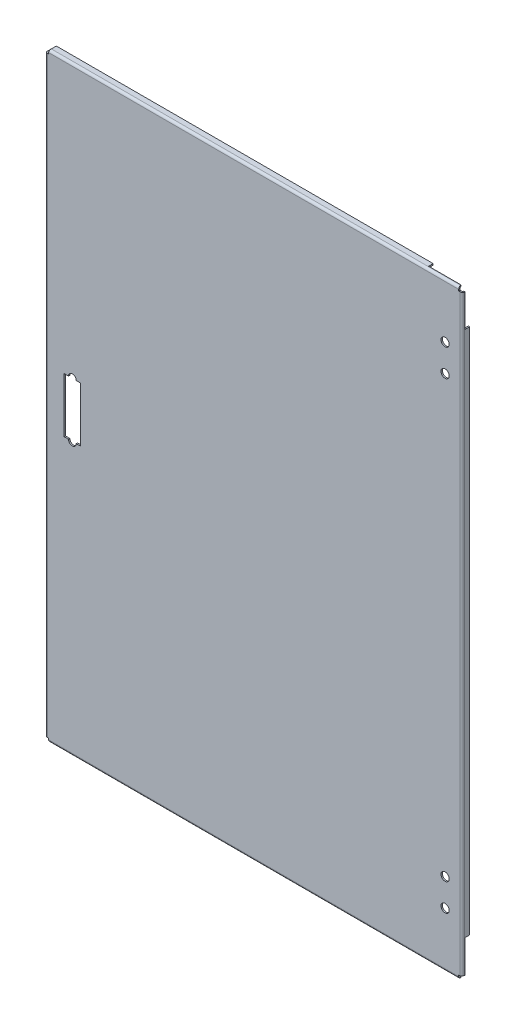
ISO-10303-21;
HEADER;
FILE_DESCRIPTION(('STEP AP214'),'2;1');
FILE_NAME('part.step','',(''),(''),'','','');
FILE_SCHEMA(('AUTOMOTIVE_DESIGN { 1 0 10303 214 1 1 1 1 }'));
ENDSEC;
DATA;
#1=APPLICATION_CONTEXT('core data for automotive mechanical design processes');
#2=APPLICATION_PROTOCOL_DEFINITION('international standard','automotive_design',2000,#1);
#3=PRODUCT_CONTEXT('',#1,'mechanical');
#4=PRODUCT('Part','Part','',(#3));
#5=PRODUCT_RELATED_PRODUCT_CATEGORY('part','',(#4));
#6=PRODUCT_DEFINITION_FORMATION('','',#4);
#7=PRODUCT_DEFINITION_CONTEXT('part definition',#1,'design');
#8=PRODUCT_DEFINITION('design','',#6,#7);
#9=PRODUCT_DEFINITION_SHAPE('','',#8);
#10=(LENGTH_UNIT() NAMED_UNIT(*) SI_UNIT(.MILLI.,.METRE.));
#11=(NAMED_UNIT(*) PLANE_ANGLE_UNIT() SI_UNIT($,.RADIAN.));
#12=(NAMED_UNIT(*) SI_UNIT($,.STERADIAN.) SOLID_ANGLE_UNIT());
#13=UNCERTAINTY_MEASURE_WITH_UNIT(LENGTH_MEASURE(1.E-05),#10,'distance_accuracy_value','');
#14=(GEOMETRIC_REPRESENTATION_CONTEXT(3) GLOBAL_UNCERTAINTY_ASSIGNED_CONTEXT((#13)) GLOBAL_UNIT_ASSIGNED_CONTEXT((#10,
#11,#12)) REPRESENTATION_CONTEXT('',''));
#15=CARTESIAN_POINT('',(0.,0.,0.));
#16=DIRECTION('',(0.,0.,1.));
#17=DIRECTION('',(1.,0.,0.));
#18=AXIS2_PLACEMENT_3D('',#15,#16,#17);
#19=CARTESIAN_POINT('',(-229.,329.,8.));
#20=DIRECTION('',(0.,-1.,0.));
#21=DIRECTION('',(0.,0.,-1.));
#22=AXIS2_PLACEMENT_3D('',#19,#20,#21);
#23=PLANE('',#22);
#24=DIRECTION('',(-1.,0.,0.));
#25=VECTOR('',#24,1.);
#26=CARTESIAN_POINT('',(-229.,329.,5.));
#27=LINE('',#26,#25);
#28=CARTESIAN_POINT('',(189.,329.,5.));
#29=VERTEX_POINT('',#28);
#30=CARTESIAN_POINT('',(224.585786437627,329.,5.));
#31=VERTEX_POINT('',#30);
#32=EDGE_CURVE('E463',#29,#31,#27,.F.);
#33=ORIENTED_EDGE('',*,*,#32,.F.);
#34=DIRECTION('',(0.,0.,1.));
#35=VECTOR('',#34,1.);
#36=CARTESIAN_POINT('',(189.,329.,8.));
#37=LINE('',#36,#35);
#38=CARTESIAN_POINT('',(189.,329.,0.));
#39=VERTEX_POINT('',#38);
#40=EDGE_CURVE('E474',#29,#39,#37,.F.);
#41=ORIENTED_EDGE('',*,*,#40,.T.);
#42=DIRECTION('',(1.,0.,0.));
#43=VECTOR('',#42,1.);
#44=CARTESIAN_POINT('',(-229.,329.,0.));
#45=LINE('',#44,#43);
#46=CARTESIAN_POINT('',(-224.585786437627,329.,0.));
#47=VERTEX_POINT('',#46);
#48=EDGE_CURVE('E490',#39,#47,#45,.F.);
#49=ORIENTED_EDGE('',*,*,#48,.T.);
#50=DIRECTION('',(0.,0.,1.));
#51=VECTOR('',#50,1.);
#52=CARTESIAN_POINT('',(-224.585786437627,329.,0.));
#53=LINE('',#52,#51);
#54=CARTESIAN_POINT('',(-224.585786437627,329.,5.5));
#55=VERTEX_POINT('',#54);
#56=EDGE_CURVE('E493',#55,#47,#53,.F.);
#57=ORIENTED_EDGE('',*,*,#56,.F.);
#58=DIRECTION('',(-1.,0.,0.));
#59=VECTOR('',#58,1.);
#60=CARTESIAN_POINT('',(-229.,329.,5.5));
#61=LINE('',#60,#59);
#62=CARTESIAN_POINT('',(224.585786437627,329.,5.5));
#63=VERTEX_POINT('',#62);
#64=EDGE_CURVE('E460',#63,#55,#61,.T.);
#65=ORIENTED_EDGE('',*,*,#64,.F.);
#66=DIRECTION('',(0.,0.,-1.));
#67=VECTOR('',#66,1.);
#68=CARTESIAN_POINT('',(224.585786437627,329.,6.5));
#69=LINE('',#68,#67);
#70=EDGE_CURVE('E951',#31,#63,#69,.F.);
#71=ORIENTED_EDGE('',*,*,#70,.F.);
#72=EDGE_LOOP('',(#33,#41,#49,#57,#65,#71));
#73=FACE_BOUND('',#72,.T.);
#74=ADVANCED_FACE('F17',(#73),#23,.F.);
#75=CARTESIAN_POINT('',(-229.,329.,8.));
#76=DIRECTION('',(1.,0.,0.));
#77=DIRECTION('',(0.,1.,0.));
#78=AXIS2_PLACEMENT_3D('',#75,#76,#77);
#79=PLANE('',#78);
#80=DIRECTION('',(0.,1.,0.));
#81=VECTOR('',#80,1.);
#82=CARTESIAN_POINT('',(-229.,329.,0.));
#83=LINE('',#82,#81);
#84=CARTESIAN_POINT('',(-229.,324.585786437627,0.));
#85=VERTEX_POINT('',#84);
#86=CARTESIAN_POINT('',(-229.,-324.585786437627,0.));
#87=VERTEX_POINT('',#86);
#88=EDGE_CURVE('E451',#85,#87,#83,.F.);
#89=ORIENTED_EDGE('',*,*,#88,.T.);
#90=DIRECTION('',(0.,0.,1.));
#91=VECTOR('',#90,1.);
#92=CARTESIAN_POINT('',(-229.,-324.585786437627,0.));
#93=LINE('',#92,#91);
#94=CARTESIAN_POINT('',(-229.,-324.585786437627,5.5));
#95=VERTEX_POINT('',#94);
#96=EDGE_CURVE('E445',#95,#87,#93,.F.);
#97=ORIENTED_EDGE('',*,*,#96,.F.);
#98=DIRECTION('',(0.,-1.,0.));
#99=VECTOR('',#98,1.);
#100=CARTESIAN_POINT('',(-229.,329.,5.5));
#101=LINE('',#100,#99);
#102=CARTESIAN_POINT('',(-229.,324.585786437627,5.5));
#103=VERTEX_POINT('',#102);
#104=EDGE_CURVE('E426',#103,#95,#101,.T.);
#105=ORIENTED_EDGE('',*,*,#104,.F.);
#106=DIRECTION('',(0.,0.,1.));
#107=VECTOR('',#106,1.);
#108=CARTESIAN_POINT('',(-229.,324.585786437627,6.5));
#109=LINE('',#108,#107);
#110=EDGE_CURVE('E457',#85,#103,#109,.T.);
#111=ORIENTED_EDGE('',*,*,#110,.F.);
#112=EDGE_LOOP('',(#89,#97,#105,#111));
#113=FACE_BOUND('',#112,.T.);
#114=ADVANCED_FACE('F745',(#113),#79,.F.);
#115=CARTESIAN_POINT('',(-229.,-329.,8.));
#116=DIRECTION('',(0.,1.,0.));
#117=DIRECTION('',(0.,0.,1.));
#118=AXIS2_PLACEMENT_3D('',#115,#116,#117);
#119=PLANE('',#118);
#120=DIRECTION('',(1.,0.,0.));
#121=VECTOR('',#120,1.);
#122=CARTESIAN_POINT('',(-229.,-329.,0.));
#123=LINE('',#122,#121);
#124=CARTESIAN_POINT('',(-224.585786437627,-329.,0.));
#125=VERTEX_POINT('',#124);
#126=CARTESIAN_POINT('',(189.,-329.,0.));
#127=VERTEX_POINT('',#126);
#128=EDGE_CURVE('E429',#125,#127,#123,.T.);
#129=ORIENTED_EDGE('',*,*,#128,.T.);
#130=DIRECTION('',(0.,0.,1.));
#131=VECTOR('',#130,1.);
#132=CARTESIAN_POINT('',(189.,-329.,8.));
#133=LINE('',#132,#131);
#134=CARTESIAN_POINT('',(189.,-329.,5.));
#135=VERTEX_POINT('',#134);
#136=EDGE_CURVE('E420',#127,#135,#133,.T.);
#137=ORIENTED_EDGE('',*,*,#136,.T.);
#138=DIRECTION('',(1.,0.,0.));
#139=VECTOR('',#138,1.);
#140=CARTESIAN_POINT('',(-229.,-329.,5.));
#141=LINE('',#140,#139);
#142=CARTESIAN_POINT('',(224.585786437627,-329.,5.));
#143=VERTEX_POINT('',#142);
#144=EDGE_CURVE('E417',#135,#143,#141,.T.);
#145=ORIENTED_EDGE('',*,*,#144,.T.);
#146=DIRECTION('',(0.,0.,-1.));
#147=VECTOR('',#146,1.);
#148=CARTESIAN_POINT('',(224.585786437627,-329.,5.));
#149=LINE('',#148,#147);
#150=CARTESIAN_POINT('',(224.585786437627,-329.,5.5));
#151=VERTEX_POINT('',#150);
#152=EDGE_CURVE('E906',#151,#143,#149,.T.);
#153=ORIENTED_EDGE('',*,*,#152,.F.);
#154=DIRECTION('',(1.,0.,0.));
#155=VECTOR('',#154,1.);
#156=CARTESIAN_POINT('',(-229.,-329.,5.5));
#157=LINE('',#156,#155);
#158=CARTESIAN_POINT('',(-224.585786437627,-329.,5.5));
#159=VERTEX_POINT('',#158);
#160=EDGE_CURVE('E381',#159,#151,#157,.T.);
#161=ORIENTED_EDGE('',*,*,#160,.F.);
#162=DIRECTION('',(0.,0.,1.));
#163=VECTOR('',#162,1.);
#164=CARTESIAN_POINT('',(-224.585786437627,-329.,6.5));
#165=LINE('',#164,#163);
#166=EDGE_CURVE('E424',#125,#159,#165,.T.);
#167=ORIENTED_EDGE('',*,*,#166,.F.);
#168=EDGE_LOOP('',(#129,#137,#145,#153,#161,#167));
#169=FACE_BOUND('',#168,.T.);
#170=ADVANCED_FACE('F749',(#169),#119,.F.);
#171=CARTESIAN_POINT('',(229.,329.,8.));
#172=DIRECTION('',(-1.,0.,0.));
#173=DIRECTION('',(0.,-1.,0.));
#174=AXIS2_PLACEMENT_3D('',#171,#172,#173);
#175=PLANE('',#174);
#176=DIRECTION('',(0.,1.,0.));
#177=VECTOR('',#176,1.);
#178=CARTESIAN_POINT('',(229.,329.,5.));
#179=LINE('',#178,#177);
#180=CARTESIAN_POINT('',(229.,-324.585786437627,5.));
#181=VERTEX_POINT('',#180);
#182=CARTESIAN_POINT('',(229.,-289.,5.));
#183=VERTEX_POINT('',#182);
#184=EDGE_CURVE('E371',#181,#183,#179,.T.);
#185=ORIENTED_EDGE('',*,*,#184,.T.);
#186=DIRECTION('',(0.,0.,1.));
#187=VECTOR('',#186,1.);
#188=CARTESIAN_POINT('',(229.,-289.,8.));
#189=LINE('',#188,#187);
#190=CARTESIAN_POINT('',(229.,-289.,0.));
#191=VERTEX_POINT('',#190);
#192=EDGE_CURVE('E389',#183,#191,#189,.F.);
#193=ORIENTED_EDGE('',*,*,#192,.T.);
#194=DIRECTION('',(0.,1.,0.));
#195=VECTOR('',#194,1.);
#196=CARTESIAN_POINT('',(229.,329.,0.));
#197=LINE('',#196,#195);
#198=CARTESIAN_POINT('',(229.,289.,0.));
#199=VERTEX_POINT('',#198);
#200=EDGE_CURVE('E399',#191,#199,#197,.T.);
#201=ORIENTED_EDGE('',*,*,#200,.T.);
#202=DIRECTION('',(0.,0.,1.));
#203=VECTOR('',#202,1.);
#204=CARTESIAN_POINT('',(229.,289.,8.));
#205=LINE('',#204,#203);
#206=CARTESIAN_POINT('',(229.,289.,5.));
#207=VERTEX_POINT('',#206);
#208=EDGE_CURVE('E380',#199,#207,#205,.T.);
#209=ORIENTED_EDGE('',*,*,#208,.T.);
#210=DIRECTION('',(0.,1.,0.));
#211=VECTOR('',#210,1.);
#212=CARTESIAN_POINT('',(229.,329.,5.));
#213=LINE('',#212,#211);
#214=CARTESIAN_POINT('',(229.,324.585786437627,5.));
#215=VERTEX_POINT('',#214);
#216=EDGE_CURVE('E378',#215,#207,#213,.F.);
#217=ORIENTED_EDGE('',*,*,#216,.F.);
#218=DIRECTION('',(0.,0.,1.));
#219=VECTOR('',#218,1.);
#220=CARTESIAN_POINT('',(229.,324.585786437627,5.));
#221=LINE('',#220,#219);
#222=CARTESIAN_POINT('',(229.,324.585786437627,5.5));
#223=VERTEX_POINT('',#222);
#224=EDGE_CURVE('E386',#223,#215,#221,.F.);
#225=ORIENTED_EDGE('',*,*,#224,.F.);
#226=DIRECTION('',(0.,1.,0.));
#227=VECTOR('',#226,1.);
#228=CARTESIAN_POINT('',(229.,329.,5.5));
#229=LINE('',#228,#227);
#230=CARTESIAN_POINT('',(229.,-324.585786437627,5.5));
#231=VERTEX_POINT('',#230);
#232=EDGE_CURVE('E343',#231,#223,#229,.T.);
#233=ORIENTED_EDGE('',*,*,#232,.F.);
#234=DIRECTION('',(0.,0.,1.));
#235=VECTOR('',#234,1.);
#236=CARTESIAN_POINT('',(229.,-324.585786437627,6.5));
#237=LINE('',#236,#235);
#238=EDGE_CURVE('E1022',#181,#231,#237,.T.);
#239=ORIENTED_EDGE('',*,*,#238,.F.);
#240=EDGE_LOOP('',(#185,#193,#201,#209,#217,#225,#233,#239));
#241=FACE_BOUND('',#240,.T.);
#242=ADVANCED_FACE('F753',(#241),#175,.F.);
#243=CARTESIAN_POINT('',(-224.585786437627,327.5,0.));
#244=DIRECTION('',(-1.,0.,0.));
#245=DIRECTION('',(0.,0.,1.));
#246=AXIS2_PLACEMENT_3D('',#243,#244,#245);
#247=PLANE('',#246);
#248=DIRECTION('',(0.,1.,0.));
#249=VECTOR('',#248,1.);
#250=CARTESIAN_POINT('',(-224.585786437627,327.5,0.));
#251=LINE('',#250,#249);
#252=CARTESIAN_POINT('',(-224.585786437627,327.5,0.));
#253=VERTEX_POINT('',#252);
#254=EDGE_CURVE('E477',#47,#253,#251,.F.);
#255=ORIENTED_EDGE('',*,*,#254,.T.);
#256=DIRECTION('',(0.,0.,-1.));
#257=VECTOR('',#256,1.);
#258=CARTESIAN_POINT('',(-224.585786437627,327.5,8.));
#259=LINE('',#258,#257);
#260=CARTESIAN_POINT('',(-224.585786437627,327.5,5.5));
#261=VERTEX_POINT('',#260);
#262=EDGE_CURVE('E963',#261,#253,#259,.T.);
#263=ORIENTED_EDGE('',*,*,#262,.F.);
#264=DIRECTION('',(0.,1.,0.));
#265=VECTOR('',#264,1.);
#266=CARTESIAN_POINT('',(-224.585786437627,327.5,5.5));
#267=LINE('',#266,#265);
#268=EDGE_CURVE('E497',#261,#55,#267,.T.);
#269=ORIENTED_EDGE('',*,*,#268,.T.);
#270=ORIENTED_EDGE('',*,*,#56,.T.);
#271=EDGE_LOOP('',(#255,#263,#269,#270));
#272=FACE_BOUND('',#271,.T.);
#273=ADVANCED_FACE('F757',(#272),#247,.T.);
#274=CARTESIAN_POINT('',(-229.,327.5,0.));
#275=DIRECTION('',(0.,0.,1.));
#276=DIRECTION('',(1.,0.,0.));
#277=AXIS2_PLACEMENT_3D('',#274,#275,#276);
#278=PLANE('',#277);
#279=ORIENTED_EDGE('',*,*,#48,.F.);
#280=DIRECTION('',(0.,1.,0.));
#281=VECTOR('',#280,1.);
#282=CARTESIAN_POINT('',(189.,327.5,0.));
#283=LINE('',#282,#281);
#284=CARTESIAN_POINT('',(189.,327.5,0.));
#285=VERTEX_POINT('',#284);
#286=EDGE_CURVE('E471',#39,#285,#283,.F.);
#287=ORIENTED_EDGE('',*,*,#286,.T.);
#288=DIRECTION('',(1.,0.,0.));
#289=VECTOR('',#288,1.);
#290=CARTESIAN_POINT('',(-229.,327.5,0.));
#291=LINE('',#290,#289);
#292=EDGE_CURVE('E483',#253,#285,#291,.T.);
#293=ORIENTED_EDGE('',*,*,#292,.F.);
#294=ORIENTED_EDGE('',*,*,#254,.F.);
#295=EDGE_LOOP('',(#279,#287,#293,#294));
#296=FACE_BOUND('',#295,.T.);
#297=ADVANCED_FACE('F761',(#296),#278,.F.);
#298=CARTESIAN_POINT('',(189.,327.5,8.));
#299=DIRECTION('',(-1.,0.,0.));
#300=DIRECTION('',(0.,0.,1.));
#301=AXIS2_PLACEMENT_3D('',#298,#299,#300);
#302=PLANE('',#301);
#303=ORIENTED_EDGE('',*,*,#40,.F.);
#304=DIRECTION('',(0.,1.,0.));
#305=VECTOR('',#304,1.);
#306=CARTESIAN_POINT('',(189.,327.5,5.));
#307=LINE('',#306,#305);
#308=CARTESIAN_POINT('',(189.,327.5,5.));
#309=VERTEX_POINT('',#308);
#310=EDGE_CURVE('E466',#309,#29,#307,.T.);
#311=ORIENTED_EDGE('',*,*,#310,.F.);
#312=DIRECTION('',(0.,0.,-1.));
#313=VECTOR('',#312,1.);
#314=CARTESIAN_POINT('',(189.,327.5,8.));
#315=LINE('',#314,#313);
#316=EDGE_CURVE('E480',#285,#309,#315,.F.);
#317=ORIENTED_EDGE('',*,*,#316,.F.);
#318=ORIENTED_EDGE('',*,*,#286,.F.);
#319=EDGE_LOOP('',(#303,#311,#317,#318));
#320=FACE_BOUND('',#319,.T.);
#321=ADVANCED_FACE('F765',(#320),#302,.F.);
#322=CARTESIAN_POINT('',(-229.,327.5,5.));
#323=DIRECTION('',(0.,0.,-1.));
#324=DIRECTION('',(-1.,0.,0.));
#325=AXIS2_PLACEMENT_3D('',#322,#323,#324);
#326=PLANE('',#325);
#327=DIRECTION('',(0.,1.,0.));
#328=VECTOR('',#327,1.);
#329=CARTESIAN_POINT('',(224.585786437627,327.5,5.));
#330=LINE('',#329,#328);
#331=CARTESIAN_POINT('',(224.585786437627,327.5,5.));
#332=VERTEX_POINT('',#331);
#333=EDGE_CURVE('E465',#332,#31,#330,.T.);
#334=ORIENTED_EDGE('',*,*,#333,.F.);
#335=DIRECTION('',(1.,0.,0.));
#336=VECTOR('',#335,1.);
#337=CARTESIAN_POINT('',(-229.,327.5,5.));
#338=LINE('',#337,#336);
#339=EDGE_CURVE('E482',#309,#332,#338,.T.);
#340=ORIENTED_EDGE('',*,*,#339,.F.);
#341=ORIENTED_EDGE('',*,*,#310,.T.);
#342=ORIENTED_EDGE('',*,*,#32,.T.);
#343=EDGE_LOOP('',(#334,#340,#341,#342));
#344=FACE_BOUND('',#343,.T.);
#345=ADVANCED_FACE('F769',(#344),#326,.T.);
#346=CARTESIAN_POINT('',(224.585786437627,327.5,6.5));
#347=DIRECTION('',(1.,0.,0.));
#348=DIRECTION('',(0.,0.,-1.));
#349=AXIS2_PLACEMENT_3D('',#346,#347,#348);
#350=PLANE('',#349);
#351=DIRECTION('',(0.,1.,0.));
#352=VECTOR('',#351,1.);
#353=CARTESIAN_POINT('',(224.585786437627,328.25,5.5));
#354=LINE('',#353,#352);
#355=CARTESIAN_POINT('',(224.585786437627,327.5,5.5));
#356=VERTEX_POINT('',#355);
#357=EDGE_CURVE('E977',#356,#63,#354,.T.);
#358=ORIENTED_EDGE('',*,*,#357,.F.);
#359=DIRECTION('',(0.,0.,-1.));
#360=VECTOR('',#359,1.);
#361=CARTESIAN_POINT('',(224.585786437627,327.5,8.));
#362=LINE('',#361,#360);
#363=EDGE_CURVE('E332',#332,#356,#362,.F.);
#364=ORIENTED_EDGE('',*,*,#363,.F.);
#365=ORIENTED_EDGE('',*,*,#333,.T.);
#366=ORIENTED_EDGE('',*,*,#70,.T.);
#367=EDGE_LOOP('',(#358,#364,#365,#366));
#368=FACE_BOUND('',#367,.T.);
#369=ADVANCED_FACE('F773',(#368),#350,.T.);
#370=CARTESIAN_POINT('',(-229.,326.5,5.5));
#371=DIRECTION('',(-1.,0.,0.));
#372=DIRECTION('',(0.,0.,1.));
#373=AXIS2_PLACEMENT_3D('',#370,#371,#372);
#374=CYLINDRICAL_SURFACE('',#373,2.5);
#375=CARTESIAN_POINT('',(-225.,326.5,8.));
#376=CARTESIAN_POINT('',(-224.999990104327,326.564964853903,8.00000716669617));
#377=CARTESIAN_POINT('',(-224.998839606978,326.629914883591,7.99746790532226));
#378=CARTESIAN_POINT('',(-224.994583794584,326.759332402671,7.98735772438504));
#379=CARTESIAN_POINT('',(-224.991479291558,326.823800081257,7.97978889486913));
#380=CARTESIAN_POINT('',(-224.983649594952,326.95171922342,7.95970195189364));
#381=CARTESIAN_POINT('',(-224.978927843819,327.015172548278,7.94719434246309));
#382=CARTESIAN_POINT('',(-224.96812996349,327.140803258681,7.91734262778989));
#383=CARTESIAN_POINT('',(-224.96205368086,327.202980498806,7.8999979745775));
#384=CARTESIAN_POINT('',(-224.941762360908,327.390804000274,7.8396736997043));
#385=CARTESIAN_POINT('',(-224.925746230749,327.513884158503,7.78900635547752));
#386=CARTESIAN_POINT('',(-224.89083277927,327.750137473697,7.66904322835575));
#387=CARTESIAN_POINT('',(-224.871933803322,327.863304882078,7.59973672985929));
#388=CARTESIAN_POINT('',(-224.831621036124,328.083286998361,7.43977461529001));
#389=CARTESIAN_POINT('',(-224.810125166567,328.189364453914,7.34812208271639));
#390=CARTESIAN_POINT('',(-224.767235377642,328.384777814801,7.14837717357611));
#391=CARTESIAN_POINT('',(-224.745841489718,328.474108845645,7.04028002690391));
#392=CARTESIAN_POINT('',(-224.704466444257,328.635002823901,6.80844024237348));
#393=CARTESIAN_POINT('',(-224.684516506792,328.706227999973,6.6844572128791));
#394=CARTESIAN_POINT('',(-224.648372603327,328.82663662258,6.4257888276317));
#395=CARTESIAN_POINT('',(-224.632175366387,328.875839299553,6.2911129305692));
#396=CARTESIAN_POINT('',(-224.608970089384,328.941905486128,6.04696003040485));
#397=CARTESIAN_POINT('',(-224.60070102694,328.963628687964,5.93890652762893));
#398=CARTESIAN_POINT('',(-224.592011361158,328.985416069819,5.77521638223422));
#399=CARTESIAN_POINT('',(-224.589733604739,328.990878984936,5.72035946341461));
#400=CARTESIAN_POINT('',(-224.586623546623,328.99817269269,5.610341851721));
#401=CARTESIAN_POINT('',(-224.585791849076,329.000001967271,5.55518104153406));
#402=CARTESIAN_POINT('',(-224.585786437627,329.,5.5));
#403=B_SPLINE_CURVE_WITH_KNOTS('',3,(#375,#376,#377,#378,#379,#380,#381,#382,#383,#384,#385,
#386,#387,#388,#389,#390,#391,#392,#393,#394,#395,#396,#397,#398,#399,#400,#401,#402),
.UNSPECIFIED.,.F.,.F.,(4,2,2,2,2,2,2,2,2,2,2,2,2,4),(0.,0.194812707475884,0.389544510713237,
0.583864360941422,0.77820623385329,1.17849622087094,1.57901682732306,2.00252209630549,
2.4261504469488,2.8571815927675,3.28783561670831,3.61833762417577,3.78373858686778,
3.94920863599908),.UNSPECIFIED.);
#404=CARTESIAN_POINT('',(-225.,326.5,8.));
#405=VERTEX_POINT('',#404);
#406=EDGE_CURVE('E24',#405,#55,#403,.T.);
#407=ORIENTED_EDGE('',*,*,#406,.F.);
#408=DIRECTION('',(1.,0.,0.));
#409=VECTOR('',#408,1.);
#410=CARTESIAN_POINT('',(0.,326.5,8.));
#411=LINE('',#410,#409);
#412=CARTESIAN_POINT('',(225.,326.5,8.));
#413=VERTEX_POINT('',#412);
#414=EDGE_CURVE('E169',#413,#405,#411,.F.);
#415=ORIENTED_EDGE('',*,*,#414,.F.);
#416=CARTESIAN_POINT('',(224.585786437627,329.,5.5));
#417=CARTESIAN_POINT('',(224.585796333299,329.000007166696,5.56496485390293));
#418=CARTESIAN_POINT('',(224.586946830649,328.997467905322,5.62991488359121));
#419=CARTESIAN_POINT('',(224.591202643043,328.987357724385,5.75933240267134));
#420=CARTESIAN_POINT('',(224.594307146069,328.979788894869,5.82380008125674));
#421=CARTESIAN_POINT('',(224.602136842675,328.959701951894,5.95171922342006));
#422=CARTESIAN_POINT('',(224.606858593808,328.947194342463,6.01517254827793));
#423=CARTESIAN_POINT('',(224.617656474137,328.91734262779,6.14080325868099));
#424=CARTESIAN_POINT('',(224.623732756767,328.899997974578,6.20298049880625));
#425=CARTESIAN_POINT('',(224.644024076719,328.839673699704,6.39080400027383));
#426=CARTESIAN_POINT('',(224.660040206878,328.789006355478,6.51388415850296));
#427=CARTESIAN_POINT('',(224.694953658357,328.669043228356,6.75013747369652));
#428=CARTESIAN_POINT('',(224.713852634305,328.599736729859,6.86330488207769));
#429=CARTESIAN_POINT('',(224.754165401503,328.43977461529,7.08328699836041));
#430=CARTESIAN_POINT('',(224.77566127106,328.348122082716,7.18936445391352));
#431=CARTESIAN_POINT('',(224.818551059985,328.148377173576,7.38477781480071));
#432=CARTESIAN_POINT('',(224.839944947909,328.040280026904,7.4741088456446));
#433=CARTESIAN_POINT('',(224.88131999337,327.808440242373,7.63500282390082));
#434=CARTESIAN_POINT('',(224.901269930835,327.684457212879,7.70622799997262));
#435=CARTESIAN_POINT('',(224.9374138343,327.425788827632,7.82663662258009));
#436=CARTESIAN_POINT('',(224.95361107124,327.291112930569,7.87583929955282));
#437=CARTESIAN_POINT('',(224.976816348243,327.046960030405,7.9419054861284));
#438=CARTESIAN_POINT('',(224.985085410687,326.938906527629,7.96362868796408));
#439=CARTESIAN_POINT('',(224.993775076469,326.775216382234,7.98541606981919));
#440=CARTESIAN_POINT('',(224.996052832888,326.720359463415,7.99087898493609));
#441=CARTESIAN_POINT('',(224.999162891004,326.610341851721,7.99817269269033));
#442=CARTESIAN_POINT('',(224.999994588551,326.555181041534,8.0000019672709));
#443=CARTESIAN_POINT('',(225.,326.5,8.));
#444=B_SPLINE_CURVE_WITH_KNOTS('',3,(#416,#417,#418,#419,#420,#421,#422,#423,#424,#425,#426,
#427,#428,#429,#430,#431,#432,#433,#434,#435,#436,#437,#438,#439,#440,#441,#442,#443),
.UNSPECIFIED.,.F.,.F.,(4,2,2,2,2,2,2,2,2,2,2,2,2,4),(0.,0.194812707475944,0.389544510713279,
0.583864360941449,0.778206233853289,1.17849622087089,1.57901682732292,2.00252209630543,
2.42615044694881,2.85718159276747,3.28783561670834,3.6183376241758,3.78373858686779,
3.94920863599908),.UNSPECIFIED.);
#445=EDGE_CURVE('E663',#63,#413,#444,.T.);
#446=ORIENTED_EDGE('',*,*,#445,.F.);
#447=ORIENTED_EDGE('',*,*,#64,.T.);
#448=EDGE_LOOP('',(#407,#415,#446,#447));
#449=FACE_BOUND('',#448,.T.);
#450=ADVANCED_FACE('F776',(#449),#374,.T.);
#451=CARTESIAN_POINT('',(-227.5,324.585786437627,6.5));
#452=DIRECTION('',(0.,1.,0.));
#453=DIRECTION('',(-1.,0.,0.));
#454=AXIS2_PLACEMENT_3D('',#451,#452,#453);
#455=PLANE('',#454);
#456=DIRECTION('',(-1.,0.,0.));
#457=VECTOR('',#456,1.);
#458=CARTESIAN_POINT('',(-227.5,324.585786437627,5.5));
#459=LINE('',#458,#457);
#460=CARTESIAN_POINT('',(-227.5,324.585786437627,5.5));
#461=VERTEX_POINT('',#460);
#462=EDGE_CURVE('E459',#103,#461,#459,.F.);
#463=ORIENTED_EDGE('',*,*,#462,.T.);
#464=DIRECTION('',(0.,0.,1.));
#465=VECTOR('',#464,1.);
#466=CARTESIAN_POINT('',(-227.5,324.585786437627,8.));
#467=LINE('',#466,#465);
#468=CARTESIAN_POINT('',(-227.5,324.585786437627,0.));
#469=VERTEX_POINT('',#468);
#470=EDGE_CURVE('E1080',#469,#461,#467,.T.);
#471=ORIENTED_EDGE('',*,*,#470,.F.);
#472=DIRECTION('',(1.,0.,0.));
#473=VECTOR('',#472,1.);
#474=CARTESIAN_POINT('',(-227.5,324.585786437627,0.));
#475=LINE('',#474,#473);
#476=EDGE_CURVE('E447',#469,#85,#475,.F.);
#477=ORIENTED_EDGE('',*,*,#476,.T.);
#478=ORIENTED_EDGE('',*,*,#110,.T.);
#479=EDGE_LOOP('',(#463,#471,#477,#478));
#480=FACE_BOUND('',#479,.T.);
#481=ADVANCED_FACE('F781',(#480),#455,.T.);
#482=CARTESIAN_POINT('',(-227.5,-324.585786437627,0.));
#483=DIRECTION('',(0.,-1.,0.));
#484=DIRECTION('',(1.,0.,0.));
#485=AXIS2_PLACEMENT_3D('',#482,#483,#484);
#486=PLANE('',#485);
#487=DIRECTION('',(1.,0.,0.));
#488=VECTOR('',#487,1.);
#489=CARTESIAN_POINT('',(-227.5,-324.585786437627,0.));
#490=LINE('',#489,#488);
#491=CARTESIAN_POINT('',(-227.5,-324.585786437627,0.));
#492=VERTEX_POINT('',#491);
#493=EDGE_CURVE('E454',#87,#492,#490,.T.);
#494=ORIENTED_EDGE('',*,*,#493,.T.);
#495=DIRECTION('',(0.,0.,1.));
#496=VECTOR('',#495,1.);
#497=CARTESIAN_POINT('',(-227.5,-324.585786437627,8.));
#498=LINE('',#497,#496);
#499=CARTESIAN_POINT('',(-227.5,-324.585786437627,5.5));
#500=VERTEX_POINT('',#499);
#501=EDGE_CURVE('E941',#500,#492,#498,.F.);
#502=ORIENTED_EDGE('',*,*,#501,.F.);
#503=DIRECTION('',(1.,0.,0.));
#504=VECTOR('',#503,1.);
#505=CARTESIAN_POINT('',(-227.5,-324.585786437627,5.5));
#506=LINE('',#505,#504);
#507=EDGE_CURVE('E448',#500,#95,#506,.F.);
#508=ORIENTED_EDGE('',*,*,#507,.T.);
#509=ORIENTED_EDGE('',*,*,#96,.T.);
#510=EDGE_LOOP('',(#494,#502,#508,#509));
#511=FACE_BOUND('',#510,.T.);
#512=ADVANCED_FACE('F785',(#511),#486,.T.);
#513=CARTESIAN_POINT('',(-227.5,329.,0.));
#514=DIRECTION('',(0.,0.,1.));
#515=DIRECTION('',(1.,0.,0.));
#516=AXIS2_PLACEMENT_3D('',#513,#514,#515);
#517=PLANE('',#516);
#518=ORIENTED_EDGE('',*,*,#88,.F.);
#519=ORIENTED_EDGE('',*,*,#476,.F.);
#520=DIRECTION('',(0.,1.,0.));
#521=VECTOR('',#520,1.);
#522=CARTESIAN_POINT('',(-227.5,329.,0.));
#523=LINE('',#522,#521);
#524=EDGE_CURVE('E938',#492,#469,#523,.T.);
#525=ORIENTED_EDGE('',*,*,#524,.F.);
#526=ORIENTED_EDGE('',*,*,#493,.F.);
#527=EDGE_LOOP('',(#518,#519,#525,#526));
#528=FACE_BOUND('',#527,.T.);
#529=ADVANCED_FACE('F653',(#528),#517,.F.);
#530=CARTESIAN_POINT('',(-226.5,329.,5.5));
#531=DIRECTION('',(0.,-1.,0.));
#532=DIRECTION('',(1.,0.,0.));
#533=AXIS2_PLACEMENT_3D('',#530,#531,#532);
#534=CYLINDRICAL_SURFACE('',#533,2.5);
#535=CARTESIAN_POINT('',(-226.5,-325.,8.));
#536=CARTESIAN_POINT('',(-226.564964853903,-324.999990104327,8.00000716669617));
#537=CARTESIAN_POINT('',(-226.629914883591,-324.998839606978,7.99746790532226));
#538=CARTESIAN_POINT('',(-226.759332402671,-324.994583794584,7.98735772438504));
#539=CARTESIAN_POINT('',(-226.823800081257,-324.991479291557,7.97978889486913));
#540=CARTESIAN_POINT('',(-226.95171922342,-324.983649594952,7.95970195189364));
#541=CARTESIAN_POINT('',(-227.015172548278,-324.978927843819,7.94719434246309));
#542=CARTESIAN_POINT('',(-227.140803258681,-324.96812996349,7.9173426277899));
#543=CARTESIAN_POINT('',(-227.202980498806,-324.96205368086,7.8999979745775));
#544=CARTESIAN_POINT('',(-227.390804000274,-324.941762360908,7.83967369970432));
#545=CARTESIAN_POINT('',(-227.513884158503,-324.925746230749,7.78900635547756));
#546=CARTESIAN_POINT('',(-227.750137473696,-324.89083277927,7.66904322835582));
#547=CARTESIAN_POINT('',(-227.863304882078,-324.871933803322,7.59973672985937));
#548=CARTESIAN_POINT('',(-228.08328699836,-324.831621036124,7.4397746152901));
#549=CARTESIAN_POINT('',(-228.189364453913,-324.810125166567,7.34812208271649));
#550=CARTESIAN_POINT('',(-228.384777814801,-324.767235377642,7.14837717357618));
#551=CARTESIAN_POINT('',(-228.474108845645,-324.745841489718,7.04028002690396));
#552=CARTESIAN_POINT('',(-228.635002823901,-324.704466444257,6.80844024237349));
#553=CARTESIAN_POINT('',(-228.706227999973,-324.684516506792,6.6844572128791));
#554=CARTESIAN_POINT('',(-228.82663662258,-324.648372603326,6.42578882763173));
#555=CARTESIAN_POINT('',(-228.875839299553,-324.632175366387,6.29111293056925));
#556=CARTESIAN_POINT('',(-228.941905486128,-324.608970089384,6.0469600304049));
#557=CARTESIAN_POINT('',(-228.963628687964,-324.60070102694,5.93890652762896));
#558=CARTESIAN_POINT('',(-228.985416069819,-324.592011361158,5.77521638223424));
#559=CARTESIAN_POINT('',(-228.990878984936,-324.589733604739,5.72035946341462));
#560=CARTESIAN_POINT('',(-228.99817269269,-324.586623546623,5.610341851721));
#561=CARTESIAN_POINT('',(-229.000001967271,-324.585791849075,5.55518104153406));
#562=CARTESIAN_POINT('',(-229.,-324.585786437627,5.5));
#563=B_SPLINE_CURVE_WITH_KNOTS('',3,(#535,#536,#537,#538,#539,#540,#541,#542,#543,#544,#545,
#546,#547,#548,#549,#550,#551,#552,#553,#554,#555,#556,#557,#558,#559,#560,#561,#562),
.UNSPECIFIED.,.F.,.F.,(4,2,2,2,2,2,2,2,2,2,2,2,2,4),(0.,0.194812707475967,0.389544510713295,
0.583864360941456,0.778206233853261,1.17849622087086,1.57901682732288,2.0025220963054,
2.42615044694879,2.85718159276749,3.2878356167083,3.61833762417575,3.78373858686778,
3.94920863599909),.UNSPECIFIED.);
#564=CARTESIAN_POINT('',(-226.5,-325.,8.));
#565=VERTEX_POINT('',#564);
#566=EDGE_CURVE('E657',#565,#95,#563,.T.);
#567=ORIENTED_EDGE('',*,*,#566,.F.);
#568=DIRECTION('',(0.,1.,0.));
#569=VECTOR('',#568,1.);
#570=CARTESIAN_POINT('',(-226.5,0.,8.));
#571=LINE('',#570,#569);
#572=CARTESIAN_POINT('',(-226.5,325.,8.));
#573=VERTEX_POINT('',#572);
#574=EDGE_CURVE('E356',#573,#565,#571,.F.);
#575=ORIENTED_EDGE('',*,*,#574,.F.);
#576=CARTESIAN_POINT('',(-229.,324.585786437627,5.5));
#577=CARTESIAN_POINT('',(-229.000007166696,324.5857963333,5.56496485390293));
#578=CARTESIAN_POINT('',(-228.997467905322,324.586946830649,5.6299148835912));
#579=CARTESIAN_POINT('',(-228.987357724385,324.591202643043,5.75933240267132));
#580=CARTESIAN_POINT('',(-228.979788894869,324.59430714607,5.82380008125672));
#581=CARTESIAN_POINT('',(-228.959701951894,324.602136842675,5.95171922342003));
#582=CARTESIAN_POINT('',(-228.947194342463,324.606858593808,6.01517254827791));
#583=CARTESIAN_POINT('',(-228.91734262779,324.617656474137,6.14080325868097));
#584=CARTESIAN_POINT('',(-228.899997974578,324.623732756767,6.20298049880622));
#585=CARTESIAN_POINT('',(-228.839673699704,324.644024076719,6.39080400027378));
#586=CARTESIAN_POINT('',(-228.789006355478,324.660040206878,6.51388415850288));
#587=CARTESIAN_POINT('',(-228.669043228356,324.694953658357,6.7501374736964));
#588=CARTESIAN_POINT('',(-228.59973672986,324.713852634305,6.86330488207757));
#589=CARTESIAN_POINT('',(-228.43977461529,324.754165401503,7.08328699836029));
#590=CARTESIAN_POINT('',(-228.348122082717,324.77566127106,7.18936445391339));
#591=CARTESIAN_POINT('',(-228.148377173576,324.818551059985,7.38477781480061));
#592=CARTESIAN_POINT('',(-228.040280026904,324.839944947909,7.47410884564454));
#593=CARTESIAN_POINT('',(-227.808440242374,324.88131999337,7.63500282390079));
#594=CARTESIAN_POINT('',(-227.684457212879,324.901269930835,7.70622799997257));
#595=CARTESIAN_POINT('',(-227.425788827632,324.9374138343,7.82663662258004));
#596=CARTESIAN_POINT('',(-227.291112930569,324.95361107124,7.8758392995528));
#597=CARTESIAN_POINT('',(-227.046960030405,324.976816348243,7.94190548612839));
#598=CARTESIAN_POINT('',(-226.938906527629,324.985085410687,7.96362868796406));
#599=CARTESIAN_POINT('',(-226.775216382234,324.993775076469,7.98541606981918));
#600=CARTESIAN_POINT('',(-226.720359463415,324.996052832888,7.99087898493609));
#601=CARTESIAN_POINT('',(-226.610341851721,324.999162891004,7.99817269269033));
#602=CARTESIAN_POINT('',(-226.555181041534,324.999994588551,8.0000019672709));
#603=CARTESIAN_POINT('',(-226.5,325.,8.));
#604=B_SPLINE_CURVE_WITH_KNOTS('',3,(#576,#577,#578,#579,#580,#581,#582,#583,#584,#585,#586,
#587,#588,#589,#590,#591,#592,#593,#594,#595,#596,#597,#598,#599,#600,#601,#602,#603),
.UNSPECIFIED.,.F.,.F.,(4,2,2,2,2,2,2,2,2,2,2,2,2,4),(0.,0.194812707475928,0.389544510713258,
0.583864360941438,0.778206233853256,1.17849622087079,1.57901682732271,2.00252209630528,
2.4261504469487,2.85718159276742,3.28783561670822,3.6183376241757,3.78373858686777,
3.94920863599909),.UNSPECIFIED.);
#605=EDGE_CURVE('E615',#103,#573,#604,.T.);
#606=ORIENTED_EDGE('',*,*,#605,.F.);
#607=ORIENTED_EDGE('',*,*,#104,.T.);
#608=EDGE_LOOP('',(#567,#575,#606,#607));
#609=FACE_BOUND('',#608,.T.);
#610=ADVANCED_FACE('F648',(#609),#534,.T.);
#611=CARTESIAN_POINT('',(-224.585786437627,-327.5,6.5));
#612=DIRECTION('',(-1.,0.,0.));
#613=DIRECTION('',(0.,0.,1.));
#614=AXIS2_PLACEMENT_3D('',#611,#612,#613);
#615=PLANE('',#614);
#616=DIRECTION('',(0.,1.,0.));
#617=VECTOR('',#616,1.);
#618=CARTESIAN_POINT('',(-224.585786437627,-327.5,5.5));
#619=LINE('',#618,#617);
#620=CARTESIAN_POINT('',(-224.585786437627,-327.5,5.5));
#621=VERTEX_POINT('',#620);
#622=EDGE_CURVE('E421',#159,#621,#619,.T.);
#623=ORIENTED_EDGE('',*,*,#622,.T.);
#624=DIRECTION('',(0.,0.,1.));
#625=VECTOR('',#624,1.);
#626=CARTESIAN_POINT('',(-224.585786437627,-327.5,8.));
#627=LINE('',#626,#625);
#628=CARTESIAN_POINT('',(-224.585786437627,-327.5,0.));
#629=VERTEX_POINT('',#628);
#630=EDGE_CURVE('E1069',#629,#621,#627,.T.);
#631=ORIENTED_EDGE('',*,*,#630,.F.);
#632=DIRECTION('',(0.,1.,0.));
#633=VECTOR('',#632,1.);
#634=CARTESIAN_POINT('',(-224.585786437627,-327.5,0.));
#635=LINE('',#634,#633);
#636=EDGE_CURVE('E433',#629,#125,#635,.F.);
#637=ORIENTED_EDGE('',*,*,#636,.T.);
#638=ORIENTED_EDGE('',*,*,#166,.T.);
#639=EDGE_LOOP('',(#623,#631,#637,#638));
#640=FACE_BOUND('',#639,.T.);
#641=ADVANCED_FACE('F645',(#640),#615,.T.);
#642=CARTESIAN_POINT('',(-229.,-327.5,5.));
#643=DIRECTION('',(0.,0.,1.));
#644=DIRECTION('',(1.,0.,0.));
#645=AXIS2_PLACEMENT_3D('',#642,#643,#644);
#646=PLANE('',#645);
#647=ORIENTED_EDGE('',*,*,#144,.F.);
#648=DIRECTION('',(0.,1.,0.));
#649=VECTOR('',#648,1.);
#650=CARTESIAN_POINT('',(189.,-327.5,5.));
#651=LINE('',#650,#649);
#652=CARTESIAN_POINT('',(189.,-327.5,5.));
#653=VERTEX_POINT('',#652);
#654=EDGE_CURVE('E436',#135,#653,#651,.T.);
#655=ORIENTED_EDGE('',*,*,#654,.T.);
#656=DIRECTION('',(1.,0.,0.));
#657=VECTOR('',#656,1.);
#658=CARTESIAN_POINT('',(-229.,-327.5,5.));
#659=LINE('',#658,#657);
#660=CARTESIAN_POINT('',(224.585786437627,-327.5,5.));
#661=VERTEX_POINT('',#660);
#662=EDGE_CURVE('E915',#661,#653,#659,.F.);
#663=ORIENTED_EDGE('',*,*,#662,.F.);
#664=DIRECTION('',(0.,1.,0.));
#665=VECTOR('',#664,1.);
#666=CARTESIAN_POINT('',(224.585786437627,-327.5,5.));
#667=LINE('',#666,#665);
#668=EDGE_CURVE('E905',#143,#661,#667,.T.);
#669=ORIENTED_EDGE('',*,*,#668,.F.);
#670=EDGE_LOOP('',(#647,#655,#663,#669));
#671=FACE_BOUND('',#670,.T.);
#672=ADVANCED_FACE('F641',(#671),#646,.F.);
#673=CARTESIAN_POINT('',(189.,-327.5,8.));
#674=DIRECTION('',(-1.,0.,0.));
#675=DIRECTION('',(0.,0.,1.));
#676=AXIS2_PLACEMENT_3D('',#673,#674,#675);
#677=PLANE('',#676);
#678=ORIENTED_EDGE('',*,*,#136,.F.);
#679=DIRECTION('',(0.,1.,0.));
#680=VECTOR('',#679,1.);
#681=CARTESIAN_POINT('',(189.,-327.5,0.));
#682=LINE('',#681,#680);
#683=CARTESIAN_POINT('',(189.,-327.5,0.));
#684=VERTEX_POINT('',#683);
#685=EDGE_CURVE('E432',#127,#684,#682,.T.);
#686=ORIENTED_EDGE('',*,*,#685,.T.);
#687=DIRECTION('',(0.,0.,1.));
#688=VECTOR('',#687,1.);
#689=CARTESIAN_POINT('',(189.,-327.5,8.));
#690=LINE('',#689,#688);
#691=EDGE_CURVE('E918',#653,#684,#690,.F.);
#692=ORIENTED_EDGE('',*,*,#691,.F.);
#693=ORIENTED_EDGE('',*,*,#654,.F.);
#694=EDGE_LOOP('',(#678,#686,#692,#693));
#695=FACE_BOUND('',#694,.T.);
#696=ADVANCED_FACE('F637',(#695),#677,.F.);
#697=CARTESIAN_POINT('',(-229.,-327.5,0.));
#698=DIRECTION('',(0.,0.,1.));
#699=DIRECTION('',(1.,0.,0.));
#700=AXIS2_PLACEMENT_3D('',#697,#698,#699);
#701=PLANE('',#700);
#702=ORIENTED_EDGE('',*,*,#128,.F.);
#703=ORIENTED_EDGE('',*,*,#636,.F.);
#704=DIRECTION('',(1.,0.,0.));
#705=VECTOR('',#704,1.);
#706=CARTESIAN_POINT('',(-229.,-327.5,0.));
#707=LINE('',#706,#705);
#708=EDGE_CURVE('E923',#684,#629,#707,.F.);
#709=ORIENTED_EDGE('',*,*,#708,.F.);
#710=ORIENTED_EDGE('',*,*,#685,.F.);
#711=EDGE_LOOP('',(#702,#703,#709,#710));
#712=FACE_BOUND('',#711,.T.);
#713=ADVANCED_FACE('F633',(#712),#701,.F.);
#714=CARTESIAN_POINT('',(224.585786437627,-327.5,5.));
#715=DIRECTION('',(1.,0.,0.));
#716=DIRECTION('',(0.,0.,-1.));
#717=AXIS2_PLACEMENT_3D('',#714,#715,#716);
#718=PLANE('',#717);
#719=ORIENTED_EDGE('',*,*,#668,.T.);
#720=DIRECTION('',(0.,0.,1.));
#721=VECTOR('',#720,1.);
#722=CARTESIAN_POINT('',(224.585786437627,-327.5,8.));
#723=LINE('',#722,#721);
#724=CARTESIAN_POINT('',(224.585786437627,-327.5,5.5));
#725=VERTEX_POINT('',#724);
#726=EDGE_CURVE('E919',#725,#661,#723,.F.);
#727=ORIENTED_EDGE('',*,*,#726,.F.);
#728=DIRECTION('',(0.,1.,0.));
#729=VECTOR('',#728,1.);
#730=CARTESIAN_POINT('',(224.585786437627,-328.25,5.5));
#731=LINE('',#730,#729);
#732=EDGE_CURVE('E608',#151,#725,#731,.T.);
#733=ORIENTED_EDGE('',*,*,#732,.F.);
#734=ORIENTED_EDGE('',*,*,#152,.T.);
#735=EDGE_LOOP('',(#719,#727,#733,#734));
#736=FACE_BOUND('',#735,.T.);
#737=ADVANCED_FACE('F627',(#736),#718,.T.);
#738=CARTESIAN_POINT('',(-229.,-326.5,5.5));
#739=DIRECTION('',(1.,0.,0.));
#740=DIRECTION('',(0.,0.,-1.));
#741=AXIS2_PLACEMENT_3D('',#738,#739,#740);
#742=CYLINDRICAL_SURFACE('',#741,2.5);
#743=CARTESIAN_POINT('',(225.,-326.5,8.));
#744=CARTESIAN_POINT('',(224.999990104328,-326.564964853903,8.00000716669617));
#745=CARTESIAN_POINT('',(224.998839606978,-326.629914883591,7.99746790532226));
#746=CARTESIAN_POINT('',(224.994583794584,-326.759332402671,7.98735772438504));
#747=CARTESIAN_POINT('',(224.991479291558,-326.823800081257,7.97978889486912));
#748=CARTESIAN_POINT('',(224.983649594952,-326.95171922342,7.95970195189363));
#749=CARTESIAN_POINT('',(224.978927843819,-327.015172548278,7.94719434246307));
#750=CARTESIAN_POINT('',(224.96812996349,-327.140803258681,7.91734262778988));
#751=CARTESIAN_POINT('',(224.96205368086,-327.202980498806,7.8999979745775));
#752=CARTESIAN_POINT('',(224.941762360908,-327.390804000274,7.83967369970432));
#753=CARTESIAN_POINT('',(224.925746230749,-327.513884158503,7.78900635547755));
#754=CARTESIAN_POINT('',(224.89083277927,-327.750137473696,7.66904322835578));
#755=CARTESIAN_POINT('',(224.871933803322,-327.863304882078,7.59973672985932));
#756=CARTESIAN_POINT('',(224.831621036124,-328.08328699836,7.43977461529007));
#757=CARTESIAN_POINT('',(224.810125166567,-328.189364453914,7.34812208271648));
#758=CARTESIAN_POINT('',(224.767235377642,-328.384777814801,7.14837717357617));
#759=CARTESIAN_POINT('',(224.745841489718,-328.474108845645,7.04028002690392));
#760=CARTESIAN_POINT('',(224.704466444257,-328.635002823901,6.80844024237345));
#761=CARTESIAN_POINT('',(224.684516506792,-328.706227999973,6.68445721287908));
#762=CARTESIAN_POINT('',(224.648372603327,-328.82663662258,6.42578882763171));
#763=CARTESIAN_POINT('',(224.632175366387,-328.875839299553,6.29111293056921));
#764=CARTESIAN_POINT('',(224.608970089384,-328.941905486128,6.04696003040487));
#765=CARTESIAN_POINT('',(224.60070102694,-328.963628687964,5.93890652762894));
#766=CARTESIAN_POINT('',(224.592011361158,-328.985416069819,5.77521638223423));
#767=CARTESIAN_POINT('',(224.589733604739,-328.990878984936,5.72035946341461));
#768=CARTESIAN_POINT('',(224.586623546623,-328.99817269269,5.610341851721));
#769=CARTESIAN_POINT('',(224.585791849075,-329.000001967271,5.55518104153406));
#770=CARTESIAN_POINT('',(224.585786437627,-329.,5.5));
#771=B_SPLINE_CURVE_WITH_KNOTS('',3,(#743,#744,#745,#746,#747,#748,#749,#750,#751,#752,#753,
#754,#755,#756,#757,#758,#759,#760,#761,#762,#763,#764,#765,#766,#767,#768,#769,#770),
.UNSPECIFIED.,.F.,.F.,(4,2,2,2,2,2,2,2,2,2,2,2,2,4),(0.,0.194812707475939,0.389544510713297,
0.58386436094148,0.77820623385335,1.17849622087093,1.57901682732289,2.0025220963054,
2.42615044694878,2.85718159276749,3.28783561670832,3.61833762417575,3.78373858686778,
3.94920863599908),.UNSPECIFIED.);
#772=CARTESIAN_POINT('',(225.,-326.5,8.));
#773=VERTEX_POINT('',#772);
#774=EDGE_CURVE('E600',#773,#151,#771,.T.);
#775=ORIENTED_EDGE('',*,*,#774,.F.);
#776=DIRECTION('',(1.,0.,0.));
#777=VECTOR('',#776,1.);
#778=CARTESIAN_POINT('',(0.,-326.5,8.));
#779=LINE('',#778,#777);
#780=CARTESIAN_POINT('',(-225.,-326.5,8.));
#781=VERTEX_POINT('',#780);
#782=EDGE_CURVE('E311',#781,#773,#779,.T.);
#783=ORIENTED_EDGE('',*,*,#782,.F.);
#784=CARTESIAN_POINT('',(-224.585786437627,-329.,5.5));
#785=CARTESIAN_POINT('',(-224.585796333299,-329.000007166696,5.56496485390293));
#786=CARTESIAN_POINT('',(-224.586946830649,-328.997467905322,5.6299148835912));
#787=CARTESIAN_POINT('',(-224.591202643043,-328.987357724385,5.75933240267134));
#788=CARTESIAN_POINT('',(-224.594307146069,-328.979788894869,5.82380008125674));
#789=CARTESIAN_POINT('',(-224.602136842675,-328.959701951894,5.95171922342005));
#790=CARTESIAN_POINT('',(-224.606858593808,-328.947194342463,6.01517254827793));
#791=CARTESIAN_POINT('',(-224.617656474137,-328.91734262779,6.14080325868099));
#792=CARTESIAN_POINT('',(-224.623732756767,-328.899997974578,6.20298049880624));
#793=CARTESIAN_POINT('',(-224.644024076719,-328.839673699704,6.39080400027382));
#794=CARTESIAN_POINT('',(-224.660040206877,-328.789006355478,6.51388415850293));
#795=CARTESIAN_POINT('',(-224.694953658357,-328.669043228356,6.75013747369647));
#796=CARTESIAN_POINT('',(-224.713852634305,-328.59973672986,6.86330488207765));
#797=CARTESIAN_POINT('',(-224.754165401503,-328.43977461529,7.08328699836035));
#798=CARTESIAN_POINT('',(-224.77566127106,-328.348122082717,7.18936445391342));
#799=CARTESIAN_POINT('',(-224.818551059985,-328.148377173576,7.38477781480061));
#800=CARTESIAN_POINT('',(-224.839944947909,-328.040280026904,7.47410884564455));
#801=CARTESIAN_POINT('',(-224.88131999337,-327.808440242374,7.6350028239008));
#802=CARTESIAN_POINT('',(-224.901269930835,-327.684457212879,7.70622799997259));
#803=CARTESIAN_POINT('',(-224.9374138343,-327.425788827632,7.82663662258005));
#804=CARTESIAN_POINT('',(-224.95361107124,-327.291112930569,7.8758392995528));
#805=CARTESIAN_POINT('',(-224.976816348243,-327.046960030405,7.94190548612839));
#806=CARTESIAN_POINT('',(-224.985085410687,-326.938906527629,7.96362868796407));
#807=CARTESIAN_POINT('',(-224.993775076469,-326.775216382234,7.98541606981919));
#808=CARTESIAN_POINT('',(-224.996052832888,-326.720359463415,7.99087898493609));
#809=CARTESIAN_POINT('',(-224.999162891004,-326.610341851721,7.99817269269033));
#810=CARTESIAN_POINT('',(-224.999994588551,-326.555181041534,8.0000019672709));
#811=CARTESIAN_POINT('',(-225.,-326.5,8.));
#812=B_SPLINE_CURVE_WITH_KNOTS('',3,(#784,#785,#786,#787,#788,#789,#790,#791,#792,#793,#794,
#795,#796,#797,#798,#799,#800,#801,#802,#803,#804,#805,#806,#807,#808,#809,#810,#811),
.UNSPECIFIED.,.F.,.F.,(4,2,2,2,2,2,2,2,2,2,2,2,2,4),(0.,0.194812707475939,0.389544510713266,
0.583864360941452,0.778206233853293,1.17849622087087,1.57901682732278,2.00252209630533,
2.42615044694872,2.85718159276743,3.28783561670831,3.61833762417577,3.78373858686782,
3.9492086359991),.UNSPECIFIED.);
#813=EDGE_CURVE('E610',#159,#781,#812,.T.);
#814=ORIENTED_EDGE('',*,*,#813,.F.);
#815=ORIENTED_EDGE('',*,*,#160,.T.);
#816=EDGE_LOOP('',(#775,#783,#814,#815));
#817=FACE_BOUND('',#816,.T.);
#818=ADVANCED_FACE('F621',(#817),#742,.T.);
#819=CARTESIAN_POINT('',(227.5,329.,5.));
#820=DIRECTION('',(0.,0.,-1.));
#821=DIRECTION('',(-1.,0.,0.));
#822=AXIS2_PLACEMENT_3D('',#819,#820,#821);
#823=PLANE('',#822);
#824=DIRECTION('',(1.,0.,0.));
#825=VECTOR('',#824,1.);
#826=CARTESIAN_POINT('',(227.5,289.,5.));
#827=LINE('',#826,#825);
#828=CARTESIAN_POINT('',(227.5,289.,5.));
#829=VERTEX_POINT('',#828);
#830=EDGE_CURVE('E402',#207,#829,#827,.F.);
#831=ORIENTED_EDGE('',*,*,#830,.T.);
#832=DIRECTION('',(0.,-1.,0.));
#833=VECTOR('',#832,1.);
#834=CARTESIAN_POINT('',(227.5,329.,5.));
#835=LINE('',#834,#833);
#836=CARTESIAN_POINT('',(227.5,324.585786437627,5.));
#837=VERTEX_POINT('',#836);
#838=EDGE_CURVE('E1033',#837,#829,#835,.T.);
#839=ORIENTED_EDGE('',*,*,#838,.F.);
#840=DIRECTION('',(-1.,0.,0.));
#841=VECTOR('',#840,1.);
#842=CARTESIAN_POINT('',(227.5,324.585786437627,5.));
#843=LINE('',#842,#841);
#844=EDGE_CURVE('E1027',#215,#837,#843,.T.);
#845=ORIENTED_EDGE('',*,*,#844,.F.);
#846=ORIENTED_EDGE('',*,*,#216,.T.);
#847=EDGE_LOOP('',(#831,#839,#845,#846));
#848=FACE_BOUND('',#847,.T.);
#849=ADVANCED_FACE('F626',(#848),#823,.T.);
#850=CARTESIAN_POINT('',(227.5,289.,8.));
#851=DIRECTION('',(0.,-1.,0.));
#852=DIRECTION('',(1.,0.,0.));
#853=AXIS2_PLACEMENT_3D('',#850,#851,#852);
#854=PLANE('',#853);
#855=ORIENTED_EDGE('',*,*,#208,.F.);
#856=DIRECTION('',(1.,0.,0.));
#857=VECTOR('',#856,1.);
#858=CARTESIAN_POINT('',(227.5,289.,0.));
#859=LINE('',#858,#857);
#860=CARTESIAN_POINT('',(227.5,289.,0.));
#861=VERTEX_POINT('',#860);
#862=EDGE_CURVE('E392',#199,#861,#859,.F.);
#863=ORIENTED_EDGE('',*,*,#862,.T.);
#864=DIRECTION('',(0.,0.,1.));
#865=VECTOR('',#864,1.);
#866=CARTESIAN_POINT('',(227.5,289.,8.));
#867=LINE('',#866,#865);
#868=EDGE_CURVE('E1036',#829,#861,#867,.F.);
#869=ORIENTED_EDGE('',*,*,#868,.F.);
#870=ORIENTED_EDGE('',*,*,#830,.F.);
#871=EDGE_LOOP('',(#855,#863,#869,#870));
#872=FACE_BOUND('',#871,.T.);
#873=ADVANCED_FACE('F868',(#872),#854,.F.);
#874=CARTESIAN_POINT('',(227.5,329.,0.));
#875=DIRECTION('',(0.,0.,1.));
#876=DIRECTION('',(1.,0.,0.));
#877=AXIS2_PLACEMENT_3D('',#874,#875,#876);
#878=PLANE('',#877);
#879=ORIENTED_EDGE('',*,*,#200,.F.);
#880=DIRECTION('',(-1.,0.,0.));
#881=VECTOR('',#880,1.);
#882=CARTESIAN_POINT('',(227.5,-289.,0.));
#883=LINE('',#882,#881);
#884=CARTESIAN_POINT('',(227.5,-289.,0.));
#885=VERTEX_POINT('',#884);
#886=EDGE_CURVE('E375',#191,#885,#883,.T.);
#887=ORIENTED_EDGE('',*,*,#886,.T.);
#888=DIRECTION('',(0.,-1.,0.));
#889=VECTOR('',#888,1.);
#890=CARTESIAN_POINT('',(227.5,329.,0.));
#891=LINE('',#890,#889);
#892=EDGE_CURVE('E884',#861,#885,#891,.T.);
#893=ORIENTED_EDGE('',*,*,#892,.F.);
#894=ORIENTED_EDGE('',*,*,#862,.F.);
#895=EDGE_LOOP('',(#879,#887,#893,#894));
#896=FACE_BOUND('',#895,.T.);
#897=ADVANCED_FACE('F865',(#896),#878,.F.);
#898=CARTESIAN_POINT('',(227.5,-289.,8.));
#899=DIRECTION('',(0.,1.,0.));
#900=DIRECTION('',(-1.,0.,0.));
#901=AXIS2_PLACEMENT_3D('',#898,#899,#900);
#902=PLANE('',#901);
#903=ORIENTED_EDGE('',*,*,#192,.F.);
#904=DIRECTION('',(1.,0.,0.));
#905=VECTOR('',#904,1.);
#906=CARTESIAN_POINT('',(227.5,-289.,5.));
#907=LINE('',#906,#905);
#908=CARTESIAN_POINT('',(227.5,-289.,5.));
#909=VERTEX_POINT('',#908);
#910=EDGE_CURVE('E374',#183,#909,#907,.F.);
#911=ORIENTED_EDGE('',*,*,#910,.T.);
#912=DIRECTION('',(0.,0.,1.));
#913=VECTOR('',#912,1.);
#914=CARTESIAN_POINT('',(227.5,-289.,8.));
#915=LINE('',#914,#913);
#916=EDGE_CURVE('E895',#885,#909,#915,.T.);
#917=ORIENTED_EDGE('',*,*,#916,.F.);
#918=ORIENTED_EDGE('',*,*,#886,.F.);
#919=EDGE_LOOP('',(#903,#911,#917,#918));
#920=FACE_BOUND('',#919,.T.);
#921=ADVANCED_FACE('F861',(#920),#902,.F.);
#922=CARTESIAN_POINT('',(227.5,329.,5.));
#923=DIRECTION('',(0.,0.,1.));
#924=DIRECTION('',(1.,0.,0.));
#925=AXIS2_PLACEMENT_3D('',#922,#923,#924);
#926=PLANE('',#925);
#927=ORIENTED_EDGE('',*,*,#184,.F.);
#928=DIRECTION('',(1.,0.,0.));
#929=VECTOR('',#928,1.);
#930=CARTESIAN_POINT('',(227.5,-324.585786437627,5.));
#931=LINE('',#930,#929);
#932=CARTESIAN_POINT('',(227.5,-324.585786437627,5.));
#933=VERTEX_POINT('',#932);
#934=EDGE_CURVE('E891',#933,#181,#931,.T.);
#935=ORIENTED_EDGE('',*,*,#934,.F.);
#936=DIRECTION('',(0.,-1.,0.));
#937=VECTOR('',#936,1.);
#938=CARTESIAN_POINT('',(227.5,329.,5.));
#939=LINE('',#938,#937);
#940=EDGE_CURVE('E890',#909,#933,#939,.T.);
#941=ORIENTED_EDGE('',*,*,#940,.F.);
#942=ORIENTED_EDGE('',*,*,#910,.F.);
#943=EDGE_LOOP('',(#927,#935,#941,#942));
#944=FACE_BOUND('',#943,.T.);
#945=ADVANCED_FACE('F857',(#944),#926,.F.);
#946=CARTESIAN_POINT('',(227.5,324.585786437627,5.));
#947=DIRECTION('',(0.,1.,0.));
#948=DIRECTION('',(-1.,0.,0.));
#949=AXIS2_PLACEMENT_3D('',#946,#947,#948);
#950=PLANE('',#949);
#951=ORIENTED_EDGE('',*,*,#844,.T.);
#952=DIRECTION('',(0.,0.,1.));
#953=VECTOR('',#952,1.);
#954=CARTESIAN_POINT('',(227.5,324.585786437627,8.));
#955=LINE('',#954,#953);
#956=CARTESIAN_POINT('',(227.5,324.585786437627,5.5));
#957=VERTEX_POINT('',#956);
#958=EDGE_CURVE('E1037',#957,#837,#955,.F.);
#959=ORIENTED_EDGE('',*,*,#958,.F.);
#960=DIRECTION('',(-1.,0.,0.));
#961=VECTOR('',#960,1.);
#962=CARTESIAN_POINT('',(228.25,324.585786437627,5.5));
#963=LINE('',#962,#961);
#964=EDGE_CURVE('E273',#223,#957,#963,.T.);
#965=ORIENTED_EDGE('',*,*,#964,.F.);
#966=ORIENTED_EDGE('',*,*,#224,.T.);
#967=EDGE_LOOP('',(#951,#959,#965,#966));
#968=FACE_BOUND('',#967,.T.);
#969=ADVANCED_FACE('F853',(#968),#950,.T.);
#970=CARTESIAN_POINT('',(227.5,-324.585786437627,6.5));
#971=DIRECTION('',(0.,-1.,0.));
#972=DIRECTION('',(1.,0.,0.));
#973=AXIS2_PLACEMENT_3D('',#970,#971,#972);
#974=PLANE('',#973);
#975=DIRECTION('',(1.,0.,0.));
#976=VECTOR('',#975,1.);
#977=CARTESIAN_POINT('',(228.25,-324.585786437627,5.5));
#978=LINE('',#977,#976);
#979=CARTESIAN_POINT('',(227.5,-324.585786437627,5.5));
#980=VERTEX_POINT('',#979);
#981=EDGE_CURVE('E831',#980,#231,#978,.T.);
#982=ORIENTED_EDGE('',*,*,#981,.F.);
#983=DIRECTION('',(0.,0.,1.));
#984=VECTOR('',#983,1.);
#985=CARTESIAN_POINT('',(227.5,-324.585786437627,8.));
#986=LINE('',#985,#984);
#987=EDGE_CURVE('E266',#933,#980,#986,.T.);
#988=ORIENTED_EDGE('',*,*,#987,.F.);
#989=ORIENTED_EDGE('',*,*,#934,.T.);
#990=ORIENTED_EDGE('',*,*,#238,.T.);
#991=EDGE_LOOP('',(#982,#988,#989,#990));
#992=FACE_BOUND('',#991,.T.);
#993=ADVANCED_FACE('F847',(#992),#974,.T.);
#994=CARTESIAN_POINT('',(226.5,329.,5.5));
#995=DIRECTION('',(0.,1.,0.));
#996=DIRECTION('',(-1.,0.,0.));
#997=AXIS2_PLACEMENT_3D('',#994,#995,#996);
#998=CYLINDRICAL_SURFACE('',#997,2.5);
#999=CARTESIAN_POINT('',(226.5,325.,8.));
#1000=CARTESIAN_POINT('',(226.564964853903,324.999990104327,8.00000716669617));
#1001=CARTESIAN_POINT('',(226.629914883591,324.998839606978,7.99746790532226));
#1002=CARTESIAN_POINT('',(226.759332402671,324.994583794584,7.98735772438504));
#1003=CARTESIAN_POINT('',(226.823800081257,324.991479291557,7.97978889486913));
#1004=CARTESIAN_POINT('',(226.95171922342,324.983649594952,7.95970195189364));
#1005=CARTESIAN_POINT('',(227.015172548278,324.978927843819,7.94719434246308));
#1006=CARTESIAN_POINT('',(227.140803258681,324.96812996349,7.91734262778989));
#1007=CARTESIAN_POINT('',(227.202980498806,324.96205368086,7.8999979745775));
#1008=CARTESIAN_POINT('',(227.390804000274,324.941762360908,7.83967369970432));
#1009=CARTESIAN_POINT('',(227.513884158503,324.925746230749,7.78900635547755));
#1010=CARTESIAN_POINT('',(227.750137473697,324.89083277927,7.66904322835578));
#1011=CARTESIAN_POINT('',(227.863304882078,324.871933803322,7.59973672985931));
#1012=CARTESIAN_POINT('',(228.08328699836,324.831621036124,7.43977461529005));
#1013=CARTESIAN_POINT('',(228.189364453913,324.810125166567,7.34812208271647));
#1014=CARTESIAN_POINT('',(228.384777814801,324.767235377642,7.14837717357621));
#1015=CARTESIAN_POINT('',(228.474108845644,324.745841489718,7.04028002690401));
#1016=CARTESIAN_POINT('',(228.635002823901,324.704466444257,6.80844024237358));
#1017=CARTESIAN_POINT('',(228.706227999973,324.684516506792,6.6844572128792));
#1018=CARTESIAN_POINT('',(228.82663662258,324.648372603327,6.42578882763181));
#1019=CARTESIAN_POINT('',(228.875839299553,324.632175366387,6.29111293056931));
#1020=CARTESIAN_POINT('',(228.941905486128,324.608970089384,6.04696003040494));
#1021=CARTESIAN_POINT('',(228.963628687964,324.60070102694,5.93890652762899));
#1022=CARTESIAN_POINT('',(228.985416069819,324.592011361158,5.77521638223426));
#1023=CARTESIAN_POINT('',(228.990878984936,324.589733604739,5.72035946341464));
#1024=CARTESIAN_POINT('',(228.99817269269,324.586623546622,5.61034185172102));
#1025=CARTESIAN_POINT('',(229.000001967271,324.585791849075,5.55518104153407));
#1026=CARTESIAN_POINT('',(229.,324.585786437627,5.5));
#1027=B_SPLINE_CURVE_WITH_KNOTS('',3,(#999,#1000,#1001,#1002,#1003,#1004,#1005,#1006,#1007,
#1008,#1009,#1010,#1011,#1012,#1013,#1014,#1015,#1016,#1017,#1018,#1019,#1020,#1021,#1022,#1023,
#1024,#1025,#1026),.UNSPECIFIED.,.F.,.F.,(4,2,2,2,2,2,2,2,2,2,2,2,2,4),(0.,0.194812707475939,
0.389544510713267,0.58386436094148,0.778206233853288,1.17849622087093,1.579016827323,
2.00252209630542,2.42615044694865,2.85718159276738,3.28783561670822,3.61833762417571,
3.78373858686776,3.94920863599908),.UNSPECIFIED.);
#1028=CARTESIAN_POINT('',(226.5,325.,8.));
#1029=VERTEX_POINT('',#1028);
#1030=EDGE_CURVE('E838',#1029,#223,#1027,.T.);
#1031=ORIENTED_EDGE('',*,*,#1030,.F.);
#1032=DIRECTION('',(0.,1.,0.));
#1033=VECTOR('',#1032,1.);
#1034=CARTESIAN_POINT('',(226.5,0.,8.));
#1035=LINE('',#1034,#1033);
#1036=CARTESIAN_POINT('',(226.5,-325.,8.));
#1037=VERTEX_POINT('',#1036);
#1038=EDGE_CURVE('E330',#1037,#1029,#1035,.T.);
#1039=ORIENTED_EDGE('',*,*,#1038,.F.);
#1040=CARTESIAN_POINT('',(229.,-324.585786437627,5.5));
#1041=CARTESIAN_POINT('',(229.000007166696,-324.5857963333,5.56496485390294));
#1042=CARTESIAN_POINT('',(228.997467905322,-324.586946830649,5.6299148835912));
#1043=CARTESIAN_POINT('',(228.987357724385,-324.591202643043,5.75933240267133));
#1044=CARTESIAN_POINT('',(228.979788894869,-324.594307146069,5.82380008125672));
#1045=CARTESIAN_POINT('',(228.959701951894,-324.602136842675,5.95171922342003));
#1046=CARTESIAN_POINT('',(228.947194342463,-324.606858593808,6.01517254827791));
#1047=CARTESIAN_POINT('',(228.91734262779,-324.617656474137,6.14080325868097));
#1048=CARTESIAN_POINT('',(228.899997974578,-324.623732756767,6.20298049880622));
#1049=CARTESIAN_POINT('',(228.839673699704,-324.644024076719,6.3908040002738));
#1050=CARTESIAN_POINT('',(228.789006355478,-324.660040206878,6.51388415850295));
#1051=CARTESIAN_POINT('',(228.669043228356,-324.694953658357,6.75013747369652));
#1052=CARTESIAN_POINT('',(228.599736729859,-324.713852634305,6.86330488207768));
#1053=CARTESIAN_POINT('',(228.43977461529,-324.754165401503,7.08328699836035));
#1054=CARTESIAN_POINT('',(228.348122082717,-324.77566127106,7.18936445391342));
#1055=CARTESIAN_POINT('',(228.148377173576,-324.818551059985,7.38477781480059));
#1056=CARTESIAN_POINT('',(228.040280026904,-324.839944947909,7.4741088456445));
#1057=CARTESIAN_POINT('',(227.808440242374,-324.88131999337,7.63500282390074));
#1058=CARTESIAN_POINT('',(227.684457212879,-324.901269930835,7.70622799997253));
#1059=CARTESIAN_POINT('',(227.425788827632,-324.9374138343,7.82663662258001));
#1060=CARTESIAN_POINT('',(227.291112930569,-324.95361107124,7.87583929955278));
#1061=CARTESIAN_POINT('',(227.046960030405,-324.976816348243,7.94190548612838));
#1062=CARTESIAN_POINT('',(226.938906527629,-324.985085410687,7.96362868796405));
#1063=CARTESIAN_POINT('',(226.775216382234,-324.993775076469,7.98541606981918));
#1064=CARTESIAN_POINT('',(226.720359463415,-324.996052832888,7.99087898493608));
#1065=CARTESIAN_POINT('',(226.610341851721,-324.999162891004,7.99817269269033));
#1066=CARTESIAN_POINT('',(226.555181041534,-324.999994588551,8.0000019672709));
#1067=CARTESIAN_POINT('',(226.5,-325.,8.));
#1068=B_SPLINE_CURVE_WITH_KNOTS('',3,(#1040,#1041,#1042,#1043,#1044,#1045,#1046,#1047,#1048,
#1049,#1050,#1051,#1052,#1053,#1054,#1055,#1056,#1057,#1058,#1059,#1060,#1061,#1062,#1063,#1064,
#1065,#1066,#1067),.UNSPECIFIED.,.F.,.F.,(4,2,2,2,2,2,2,2,2,2,2,2,2,4),(0.,0.194812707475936,
0.389544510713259,0.583864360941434,0.778206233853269,1.17849622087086,1.57901682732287,
2.00252209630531,2.42615044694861,2.85718159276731,3.28783561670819,3.61833762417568,
3.78373858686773,3.9492086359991),.UNSPECIFIED.);
#1069=EDGE_CURVE('E826',#231,#1037,#1068,.T.);
#1070=ORIENTED_EDGE('',*,*,#1069,.F.);
#1071=ORIENTED_EDGE('',*,*,#232,.T.);
#1072=EDGE_LOOP('',(#1031,#1039,#1070,#1071));
#1073=FACE_BOUND('',#1072,.T.);
#1074=ADVANCED_FACE('F842',(#1073),#998,.T.);
#1075=CARTESIAN_POINT('',(0.,0.,8.));
#1076=DIRECTION('',(0.,0.,1.));
#1077=DIRECTION('',(1.,0.,0.));
#1078=AXIS2_PLACEMENT_3D('',#1075,#1076,#1077);
#1079=PLANE('',#1078);
#1080=DIRECTION('',(1.,0.,0.));
#1081=VECTOR('',#1080,1.);
#1082=CARTESIAN_POINT('',(0.,-325.,8.));
#1083=LINE('',#1082,#1081);
#1084=CARTESIAN_POINT('',(225.,-325.,8.));
#1085=VERTEX_POINT('',#1084);
#1086=EDGE_CURVE('E308',#1085,#1037,#1083,.T.);
#1087=ORIENTED_EDGE('',*,*,#1086,.T.);
#1088=ORIENTED_EDGE('',*,*,#1038,.T.);
#1089=DIRECTION('',(1.,0.,0.));
#1090=VECTOR('',#1089,1.);
#1091=CARTESIAN_POINT('',(0.,325.,8.));
#1092=LINE('',#1091,#1090);
#1093=CARTESIAN_POINT('',(225.,325.,8.));
#1094=VERTEX_POINT('',#1093);
#1095=EDGE_CURVE('E340',#1029,#1094,#1092,.F.);
#1096=ORIENTED_EDGE('',*,*,#1095,.T.);
#1097=DIRECTION('',(0.,1.,0.));
#1098=VECTOR('',#1097,1.);
#1099=CARTESIAN_POINT('',(225.,0.,8.));
#1100=LINE('',#1099,#1098);
#1101=EDGE_CURVE('E342',#1094,#413,#1100,.T.);
#1102=ORIENTED_EDGE('',*,*,#1101,.T.);
#1103=ORIENTED_EDGE('',*,*,#414,.T.);
#1104=DIRECTION('',(0.,1.,0.));
#1105=VECTOR('',#1104,1.);
#1106=CARTESIAN_POINT('',(-225.,0.,8.));
#1107=LINE('',#1106,#1105);
#1108=CARTESIAN_POINT('',(-225.,325.,8.));
#1109=VERTEX_POINT('',#1108);
#1110=EDGE_CURVE('E173',#405,#1109,#1107,.F.);
#1111=ORIENTED_EDGE('',*,*,#1110,.T.);
#1112=DIRECTION('',(1.,0.,0.));
#1113=VECTOR('',#1112,1.);
#1114=CARTESIAN_POINT('',(0.,325.,8.));
#1115=LINE('',#1114,#1113);
#1116=EDGE_CURVE('E360',#1109,#573,#1115,.F.);
#1117=ORIENTED_EDGE('',*,*,#1116,.T.);
#1118=ORIENTED_EDGE('',*,*,#574,.T.);
#1119=DIRECTION('',(1.,0.,0.));
#1120=VECTOR('',#1119,1.);
#1121=CARTESIAN_POINT('',(0.,-325.,8.));
#1122=LINE('',#1121,#1120);
#1123=CARTESIAN_POINT('',(-225.,-325.,8.));
#1124=VERTEX_POINT('',#1123);
#1125=EDGE_CURVE('E351',#565,#1124,#1122,.T.);
#1126=ORIENTED_EDGE('',*,*,#1125,.T.);
#1127=DIRECTION('',(0.,1.,0.));
#1128=VECTOR('',#1127,1.);
#1129=CARTESIAN_POINT('',(-225.,0.,8.));
#1130=LINE('',#1129,#1128);
#1131=EDGE_CURVE('E349',#1124,#781,#1130,.F.);
#1132=ORIENTED_EDGE('',*,*,#1131,.T.);
#1133=ORIENTED_EDGE('',*,*,#782,.T.);
#1134=DIRECTION('',(0.,1.,0.));
#1135=VECTOR('',#1134,1.);
#1136=CARTESIAN_POINT('',(225.,0.,8.));
#1137=LINE('',#1136,#1135);
#1138=EDGE_CURVE('E303',#773,#1085,#1137,.T.);
#1139=ORIENTED_EDGE('',*,*,#1138,.T.);
#1140=EDGE_LOOP('',(#1087,#1088,#1096,#1102,#1103,#1111,#1117,#1118,#1126,#1132,#1133,#1139));
#1141=FACE_BOUND('',#1140,.T.);
#1142=DIRECTION('',(1.,0.,0.));
#1143=VECTOR('',#1142,1.);
#1144=CARTESIAN_POINT('',(0.,30.,8.));
#1145=LINE('',#1144,#1143);
#1146=CARTESIAN_POINT('',(-208.,30.,8.));
#1147=VERTEX_POINT('',#1146);
#1148=CARTESIAN_POINT('',(-203.243137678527,30.,8.));
#1149=VERTEX_POINT('',#1148);
#1150=EDGE_CURVE('E1000',#1147,#1149,#1145,.T.);
#1151=ORIENTED_EDGE('',*,*,#1150,.T.);
#1152=CARTESIAN_POINT('',(-199.,30.,8.));
#1153=DIRECTION('',(0.,0.,1.));
#1154=DIRECTION('',(1.,0.,0.));
#1155=AXIS2_PLACEMENT_3D('',#1152,#1153,#1154);
#1156=CIRCLE('',#1155,4.24313767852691);
#1157=CARTESIAN_POINT('',(-194.756862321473,30.,8.));
#1158=VERTEX_POINT('',#1157);
#1159=EDGE_CURVE('E727',#1149,#1158,#1156,.F.);
#1160=ORIENTED_EDGE('',*,*,#1159,.T.);
#1161=DIRECTION('',(1.,0.,0.));
#1162=VECTOR('',#1161,1.);
#1163=CARTESIAN_POINT('',(0.,30.,8.));
#1164=LINE('',#1163,#1162);
#1165=CARTESIAN_POINT('',(-190.,30.,8.));
#1166=VERTEX_POINT('',#1165);
#1167=EDGE_CURVE('E993',#1158,#1166,#1164,.T.);
#1168=ORIENTED_EDGE('',*,*,#1167,.T.);
#1169=DIRECTION('',(0.,1.,0.));
#1170=VECTOR('',#1169,1.);
#1171=CARTESIAN_POINT('',(-190.,0.,8.));
#1172=LINE('',#1171,#1170);
#1173=CARTESIAN_POINT('',(-190.,-30.,8.));
#1174=VERTEX_POINT('',#1173);
#1175=EDGE_CURVE('E987',#1166,#1174,#1172,.F.);
#1176=ORIENTED_EDGE('',*,*,#1175,.T.);
#1177=DIRECTION('',(1.,0.,0.));
#1178=VECTOR('',#1177,1.);
#1179=CARTESIAN_POINT('',(0.,-30.,8.));
#1180=LINE('',#1179,#1178);
#1181=CARTESIAN_POINT('',(-194.756862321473,-30.,8.));
#1182=VERTEX_POINT('',#1181);
#1183=EDGE_CURVE('E1016',#1174,#1182,#1180,.F.);
#1184=ORIENTED_EDGE('',*,*,#1183,.T.);
#1185=CARTESIAN_POINT('',(-199.,-30.,8.));
#1186=DIRECTION('',(0.,0.,1.));
#1187=DIRECTION('',(1.,0.,0.));
#1188=AXIS2_PLACEMENT_3D('',#1185,#1186,#1187);
#1189=CIRCLE('',#1188,4.24313767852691);
#1190=CARTESIAN_POINT('',(-203.243137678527,-30.,8.));
#1191=VERTEX_POINT('',#1190);
#1192=EDGE_CURVE('E1186',#1182,#1191,#1189,.F.);
#1193=ORIENTED_EDGE('',*,*,#1192,.T.);
#1194=DIRECTION('',(1.,0.,0.));
#1195=VECTOR('',#1194,1.);
#1196=CARTESIAN_POINT('',(0.,-30.,8.));
#1197=LINE('',#1196,#1195);
#1198=CARTESIAN_POINT('',(-208.,-30.,8.));
#1199=VERTEX_POINT('',#1198);
#1200=EDGE_CURVE('E1011',#1191,#1199,#1197,.F.);
#1201=ORIENTED_EDGE('',*,*,#1200,.T.);
#1202=DIRECTION('',(0.,1.,0.));
#1203=VECTOR('',#1202,1.);
#1204=CARTESIAN_POINT('',(-208.,0.,8.));
#1205=LINE('',#1204,#1203);
#1206=EDGE_CURVE('E1006',#1199,#1147,#1205,.T.);
#1207=ORIENTED_EDGE('',*,*,#1206,.T.);
#1208=EDGE_LOOP('',(#1151,#1160,#1168,#1176,#1184,#1193,#1201,#1207));
#1209=FACE_BOUND('',#1208,.T.);
#1210=CARTESIAN_POINT('',(210.,239.,8.));
#1211=DIRECTION('',(0.,0.,1.));
#1212=DIRECTION('',(1.,0.,0.));
#1213=AXIS2_PLACEMENT_3D('',#1210,#1211,#1212);
#1214=CIRCLE('',#1213,4.5);
#1215=CARTESIAN_POINT('',(214.5,239.,8.));
#1216=VERTEX_POINT('',#1215);
#1217=EDGE_CURVE('E990',#1216,#1216,#1214,.F.);
#1218=ORIENTED_EDGE('',*,*,#1217,.T.);
#1219=EDGE_LOOP('',(#1218));
#1220=FACE_BOUND('',#1219,.T.);
#1221=CARTESIAN_POINT('',(210.,269.,8.));
#1222=DIRECTION('',(0.,0.,1.));
#1223=DIRECTION('',(1.,0.,0.));
#1224=AXIS2_PLACEMENT_3D('',#1221,#1222,#1223);
#1225=CIRCLE('',#1224,4.5);
#1226=CARTESIAN_POINT('',(214.5,269.,8.));
#1227=VERTEX_POINT('',#1226);
#1228=EDGE_CURVE('E829',#1227,#1227,#1225,.F.);
#1229=ORIENTED_EDGE('',*,*,#1228,.T.);
#1230=EDGE_LOOP('',(#1229));
#1231=FACE_BOUND('',#1230,.T.);
#1232=CARTESIAN_POINT('',(210.,-239.,8.));
#1233=DIRECTION('',(0.,0.,1.));
#1234=DIRECTION('',(1.,0.,0.));
#1235=AXIS2_PLACEMENT_3D('',#1232,#1233,#1234);
#1236=CIRCLE('',#1235,4.5);
#1237=CARTESIAN_POINT('',(214.5,-239.,8.));
#1238=VERTEX_POINT('',#1237);
#1239=EDGE_CURVE('E825',#1238,#1238,#1236,.F.);
#1240=ORIENTED_EDGE('',*,*,#1239,.T.);
#1241=EDGE_LOOP('',(#1240));
#1242=FACE_BOUND('',#1241,.T.);
#1243=CARTESIAN_POINT('',(210.,-269.,8.));
#1244=DIRECTION('',(0.,0.,1.));
#1245=DIRECTION('',(1.,0.,0.));
#1246=AXIS2_PLACEMENT_3D('',#1243,#1244,#1245);
#1247=CIRCLE('',#1246,4.5);
#1248=CARTESIAN_POINT('',(214.5,-269.,8.));
#1249=VERTEX_POINT('',#1248);
#1250=EDGE_CURVE('E823',#1249,#1249,#1247,.F.);
#1251=ORIENTED_EDGE('',*,*,#1250,.T.);
#1252=EDGE_LOOP('',(#1251));
#1253=FACE_BOUND('',#1252,.T.);
#1254=ADVANCED_FACE('F305',(#1141,#1209,#1220,#1231,#1242,#1253),#1079,.T.);
#1255=CARTESIAN_POINT('',(-229.,327.5,8.));
#1256=DIRECTION('',(0.,-1.,0.));
#1257=DIRECTION('',(0.,0.,-1.));
#1258=AXIS2_PLACEMENT_3D('',#1255,#1256,#1257);
#1259=PLANE('',#1258);
#1260=ORIENTED_EDGE('',*,*,#316,.T.);
#1261=ORIENTED_EDGE('',*,*,#339,.T.);
#1262=ORIENTED_EDGE('',*,*,#363,.T.);
#1263=DIRECTION('',(-1.,0.,0.));
#1264=VECTOR('',#1263,1.);
#1265=CARTESIAN_POINT('',(-229.,327.5,5.5));
#1266=LINE('',#1265,#1264);
#1267=EDGE_CURVE('E726',#356,#261,#1266,.T.);
#1268=ORIENTED_EDGE('',*,*,#1267,.T.);
#1269=ORIENTED_EDGE('',*,*,#262,.T.);
#1270=ORIENTED_EDGE('',*,*,#292,.T.);
#1271=EDGE_LOOP('',(#1260,#1261,#1262,#1268,#1269,#1270));
#1272=FACE_BOUND('',#1271,.T.);
#1273=ADVANCED_FACE('F735',(#1272),#1259,.T.);
#1274=CARTESIAN_POINT('',(-224.585786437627,329.01515,5.5));
#1275=CARTESIAN_POINT('',(-224.585786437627,329.01515,5.80866919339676));
#1276=CARTESIAN_POINT('',(-224.611674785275,328.95653568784,6.13363135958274));
#1277=CARTESIAN_POINT('',(-224.68933982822,328.708198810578,6.74896529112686));
#1278=CARTESIAN_POINT('',(-224.741116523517,328.518482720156,7.03847652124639));
#1279=CARTESIAN_POINT('',(-224.84466991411,328.038476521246,7.51848272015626));
#1280=CARTESIAN_POINT('',(-224.896446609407,327.748965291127,7.7081988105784));
#1281=CARTESIAN_POINT('',(-224.974111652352,327.133631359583,7.95653568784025));
#1282=CARTESIAN_POINT('',(-225.,326.808669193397,8.01515));
#1283=CARTESIAN_POINT('',(-225.,326.5,8.01515));
#1284=CARTESIAN_POINT('',(-224.585786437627,329.,5.5));
#1285=CARTESIAN_POINT('',(-224.585786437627,329.,5.80680992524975));
#1286=CARTESIAN_POINT('',(-224.611674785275,328.941738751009,6.12981468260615));
#1287=CARTESIAN_POINT('',(-224.68933982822,328.694897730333,6.74144215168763));
#1288=CARTESIAN_POINT('',(-224.741116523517,328.506324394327,7.02920951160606));
#1289=CARTESIAN_POINT('',(-224.84466991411,328.029209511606,7.50632439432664));
#1290=CARTESIAN_POINT('',(-224.896446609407,327.741442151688,7.69489773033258));
#1291=CARTESIAN_POINT('',(-224.974111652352,327.129814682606,7.94173875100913));
#1292=CARTESIAN_POINT('',(-225.,326.80680992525,8.));
#1293=CARTESIAN_POINT('',(-225.,326.5,8.));
#1294=CARTESIAN_POINT('',(-224.585786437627,327.5,5.5));
#1295=CARTESIAN_POINT('',(-224.585786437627,327.5,5.6227239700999));
#1296=CARTESIAN_POINT('',(-224.611674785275,327.476695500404,5.75192587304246));
#1297=CARTESIAN_POINT('',(-224.68933982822,327.377959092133,5.99657686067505));
#1298=CARTESIAN_POINT('',(-224.741116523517,327.302529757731,6.11168380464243));
#1299=CARTESIAN_POINT('',(-224.84466991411,327.111683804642,6.30252975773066));
#1300=CARTESIAN_POINT('',(-224.896446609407,326.996576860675,6.37795909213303));
#1301=CARTESIAN_POINT('',(-224.974111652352,326.751925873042,6.47669550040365));
#1302=CARTESIAN_POINT('',(-225.,326.6227239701,6.5));
#1303=CARTESIAN_POINT('',(-225.,326.5,6.5));
#1304=CARTESIAN_POINT('',(-224.585786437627,327.485,5.5));
#1305=CARTESIAN_POINT('',(-224.585786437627,327.485,5.6208831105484));
#1306=CARTESIAN_POINT('',(-224.611674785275,327.462045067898,5.74814698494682));
#1307=CARTESIAN_POINT('',(-224.68933982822,327.364789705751,5.98912820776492));
#1308=CARTESIAN_POINT('',(-224.741116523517,327.290491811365,6.1025085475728));
#1309=CARTESIAN_POINT('',(-224.84466991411,327.102508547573,6.2904918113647));
#1310=CARTESIAN_POINT('',(-224.896446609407,326.989128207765,6.36478970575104));
#1311=CARTESIAN_POINT('',(-224.974111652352,326.748146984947,6.4620450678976));
#1312=CARTESIAN_POINT('',(-225.,326.620883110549,6.485));
#1313=CARTESIAN_POINT('',(-225.,326.5,6.485));
#1314=B_SPLINE_SURFACE_WITH_KNOTS('',1,3,((#1274,#1275,#1276,#1277,#1278,#1279,#1280,#1281,
#1282,#1283),(#1284,#1285,#1286,#1287,#1288,#1289,#1290,#1291,#1292,#1293),(#1294,#1295,#1296,
#1297,#1298,#1299,#1300,#1301,#1302,#1303),(#1304,#1305,#1306,#1307,#1308,#1309,#1310,#1311,
#1312,#1313)),.UNSPECIFIED.,.F.,.F.,.F.,(2,1,1,2),(4,2,2,2,4),(-0.0101,0.,1.,1.01),(0.,0.25,0.5,
0.75,1.),.UNSPECIFIED.);
#1315=CARTESIAN_POINT('',(-224.585786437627,327.5,5.5));
#1316=CARTESIAN_POINT('',(-224.585791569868,327.500003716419,5.52396943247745));
#1317=CARTESIAN_POINT('',(-224.586773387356,327.499137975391,5.54790535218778));
#1318=CARTESIAN_POINT('',(-224.590400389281,327.495715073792,5.59548683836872));
#1319=CARTESIAN_POINT('',(-224.593042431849,327.493161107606,5.61913286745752));
#1320=CARTESIAN_POINT('',(-224.602973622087,327.483091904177,5.68902809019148));
#1321=CARTESIAN_POINT('',(-224.612278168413,327.473167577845,5.73465915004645));
#1322=CARTESIAN_POINT('',(-224.634406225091,327.447540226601,5.82290837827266));
#1323=CARTESIAN_POINT('',(-224.647204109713,327.431879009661,5.86554574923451));
#1324=CARTESIAN_POINT('',(-224.675097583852,327.395271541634,5.94779358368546));
#1325=CARTESIAN_POINT('',(-224.690198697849,327.374312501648,5.98739641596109));
#1326=CARTESIAN_POINT('',(-224.724891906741,327.322911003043,6.07067351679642));
#1327=CARTESIAN_POINT('',(-224.744777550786,327.291409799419,6.11357339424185));
#1328=CARTESIAN_POINT('',(-224.785118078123,327.222188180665,6.19372196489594));
#1329=CARTESIAN_POINT('',(-224.805573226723,327.184464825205,6.23096797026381));
#1330=CARTESIAN_POINT('',(-224.848385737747,327.098226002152,6.30355152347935));
#1331=CARTESIAN_POINT('',(-224.870653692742,327.04894798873,6.33804227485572));
#1332=CARTESIAN_POINT('',(-224.912397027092,326.944053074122,6.3980305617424));
#1333=CARTESIAN_POINT('',(-224.931873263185,326.888438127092,6.42353085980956));
#1334=CARTESIAN_POINT('',(-224.960415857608,326.789088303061,6.45829782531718));
#1335=CARTESIAN_POINT('',(-224.970860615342,326.746640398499,6.4701313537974));
#1336=CARTESIAN_POINT('',(-224.987595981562,326.6598558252,6.4881232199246));
#1337=CARTESIAN_POINT('',(-224.993903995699,326.615527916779,6.49430537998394));
#1338=CARTESIAN_POINT('',(-224.999036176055,326.547279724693,6.49916544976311));
#1339=CARTESIAN_POINT('',(-224.999990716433,326.52364981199,6.50001170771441));
#1340=CARTESIAN_POINT('',(-225.,326.5,6.5));
#1341=B_SPLINE_CURVE_WITH_KNOTS('',3,(#1315,#1316,#1317,#1318,#1319,#1320,#1321,#1322,#1323,
#1324,#1325,#1326,#1327,#1328,#1329,#1330,#1331,#1332,#1333,#1334,#1335,#1336,#1337,#1338,#1339,
#1340),.UNSPECIFIED.,.F.,.F.,(4,2,2,2,2,2,2,2,2,2,2,2,4),(0.,0.0718194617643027,
0.143503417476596,0.28561710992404,0.426715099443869,0.56815700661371,0.737942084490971,
0.907807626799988,1.09930104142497,1.29073556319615,1.42614133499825,1.5609736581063,
1.63186947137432),.UNSPECIFIED.);
#1342=CARTESIAN_POINT('',(-225.,326.5,6.5));
#1343=VERTEX_POINT('',#1342);
#1344=EDGE_CURVE('E720',#261,#1343,#1341,.T.);
#1345=DIRECTION('',(0.,0.,1.));
#1346=VECTOR('',#1345,1.);
#1347=CARTESIAN_POINT('',(-225.,326.5,7.25));
#1348=LINE('',#1347,#1346);
#1349=EDGE_CURVE('E970',#1343,#405,#1348,.T.);
#1350=ORIENTED_EDGE('',*,*,#268,.F.);
#1351=ORIENTED_EDGE('',*,*,#1344,.T.);
#1352=ORIENTED_EDGE('',*,*,#1349,.T.);
#1353=ORIENTED_EDGE('',*,*,#406,.T.);
#1354=EDGE_LOOP('',(#1350,#1351,#1352,#1353));
#1355=FACE_BOUND('',#1354,.T.);
#1356=ADVANCED_FACE('F729',(#1355),#1314,.T.);
#1357=CARTESIAN_POINT('',(225.,326.5,8.01515));
#1358=CARTESIAN_POINT('',(225.,326.808669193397,8.01515));
#1359=CARTESIAN_POINT('',(224.974111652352,327.133631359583,7.95653568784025));
#1360=CARTESIAN_POINT('',(224.896446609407,327.748965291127,7.7081988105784));
#1361=CARTESIAN_POINT('',(224.84466991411,328.038476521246,7.51848272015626));
#1362=CARTESIAN_POINT('',(224.741116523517,328.518482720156,7.03847652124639));
#1363=CARTESIAN_POINT('',(224.68933982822,328.708198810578,6.74896529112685));
#1364=CARTESIAN_POINT('',(224.611674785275,328.95653568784,6.13363135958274));
#1365=CARTESIAN_POINT('',(224.585786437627,329.01515,5.80866919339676));
#1366=CARTESIAN_POINT('',(224.585786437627,329.01515,5.5));
#1367=CARTESIAN_POINT('',(225.,326.5,8.));
#1368=CARTESIAN_POINT('',(225.,326.80680992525,8.));
#1369=CARTESIAN_POINT('',(224.974111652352,327.129814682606,7.94173875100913));
#1370=CARTESIAN_POINT('',(224.896446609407,327.741442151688,7.69489773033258));
#1371=CARTESIAN_POINT('',(224.84466991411,328.029209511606,7.50632439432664));
#1372=CARTESIAN_POINT('',(224.741116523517,328.506324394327,7.02920951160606));
#1373=CARTESIAN_POINT('',(224.68933982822,328.694897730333,6.74144215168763));
#1374=CARTESIAN_POINT('',(224.611674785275,328.941738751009,6.12981468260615));
#1375=CARTESIAN_POINT('',(224.585786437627,329.,5.80680992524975));
#1376=CARTESIAN_POINT('',(224.585786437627,329.,5.5));
#1377=CARTESIAN_POINT('',(225.,326.5,6.5));
#1378=CARTESIAN_POINT('',(225.,326.6227239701,6.5));
#1379=CARTESIAN_POINT('',(224.974111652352,326.751925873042,6.47669550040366));
#1380=CARTESIAN_POINT('',(224.896446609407,326.996576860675,6.37795909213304));
#1381=CARTESIAN_POINT('',(224.84466991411,327.111683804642,6.30252975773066));
#1382=CARTESIAN_POINT('',(224.741116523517,327.302529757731,6.11168380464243));
#1383=CARTESIAN_POINT('',(224.68933982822,327.377959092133,5.99657686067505));
#1384=CARTESIAN_POINT('',(224.611674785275,327.476695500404,5.75192587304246));
#1385=CARTESIAN_POINT('',(224.585786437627,327.5,5.6227239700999));
#1386=CARTESIAN_POINT('',(224.585786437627,327.5,5.5));
#1387=CARTESIAN_POINT('',(225.,326.5,6.485));
#1388=CARTESIAN_POINT('',(225.,326.620883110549,6.485));
#1389=CARTESIAN_POINT('',(224.974111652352,326.748146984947,6.4620450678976));
#1390=CARTESIAN_POINT('',(224.896446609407,326.989128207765,6.36478970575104));
#1391=CARTESIAN_POINT('',(224.84466991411,327.102508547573,6.29049181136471));
#1392=CARTESIAN_POINT('',(224.741116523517,327.290491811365,6.10250854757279));
#1393=CARTESIAN_POINT('',(224.68933982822,327.364789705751,5.98912820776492));
#1394=CARTESIAN_POINT('',(224.611674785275,327.462045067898,5.74814698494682));
#1395=CARTESIAN_POINT('',(224.585786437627,327.485,5.6208831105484));
#1396=CARTESIAN_POINT('',(224.585786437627,327.485,5.5));
#1397=B_SPLINE_SURFACE_WITH_KNOTS('',1,3,((#1357,#1358,#1359,#1360,#1361,#1362,#1363,#1364,
#1365,#1366),(#1367,#1368,#1369,#1370,#1371,#1372,#1373,#1374,#1375,#1376),(#1377,#1378,#1379,
#1380,#1381,#1382,#1383,#1384,#1385,#1386),(#1387,#1388,#1389,#1390,#1391,#1392,#1393,#1394,
#1395,#1396)),.UNSPECIFIED.,.F.,.F.,.F.,(2,1,1,2),(4,2,2,2,4),(-0.0101,0.,1.,1.01),(0.,0.25,0.5,
0.75,1.),.UNSPECIFIED.);
#1398=DIRECTION('',(0.,0.,1.));
#1399=VECTOR('',#1398,1.);
#1400=CARTESIAN_POINT('',(225.,326.5,6.5));
#1401=LINE('',#1400,#1399);
#1402=CARTESIAN_POINT('',(225.,326.5,6.5));
#1403=VERTEX_POINT('',#1402);
#1404=EDGE_CURVE('E1150',#413,#1403,#1401,.F.);
#1405=CARTESIAN_POINT('',(225.,326.5,6.5));
#1406=CARTESIAN_POINT('',(224.999994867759,326.523969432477,6.50000371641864));
#1407=CARTESIAN_POINT('',(224.999013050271,326.547905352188,6.49913797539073));
#1408=CARTESIAN_POINT('',(224.995386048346,326.595486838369,6.49571507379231));
#1409=CARTESIAN_POINT('',(224.992744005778,326.619132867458,6.49316110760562));
#1410=CARTESIAN_POINT('',(224.98281281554,326.689028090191,6.48309190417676));
#1411=CARTESIAN_POINT('',(224.973508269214,326.734659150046,6.47316757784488));
#1412=CARTESIAN_POINT('',(224.951380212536,326.822908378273,6.44754022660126));
#1413=CARTESIAN_POINT('',(224.938582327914,326.865545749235,6.43187900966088));
#1414=CARTESIAN_POINT('',(224.910688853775,326.947793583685,6.3952715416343));
#1415=CARTESIAN_POINT('',(224.895587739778,326.987396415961,6.37431250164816));
#1416=CARTESIAN_POINT('',(224.860894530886,327.070673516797,6.32291100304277));
#1417=CARTESIAN_POINT('',(224.841008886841,327.113573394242,6.29140979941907));
#1418=CARTESIAN_POINT('',(224.800668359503,327.193721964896,6.22218818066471));
#1419=CARTESIAN_POINT('',(224.780213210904,327.230967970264,6.1844648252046));
#1420=CARTESIAN_POINT('',(224.73740069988,327.30355152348,6.09822600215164));
#1421=CARTESIAN_POINT('',(224.715132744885,327.338042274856,6.04894798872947));
#1422=CARTESIAN_POINT('',(224.673389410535,327.398030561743,5.94405307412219));
#1423=CARTESIAN_POINT('',(224.653913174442,327.42353085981,5.88843812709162));
#1424=CARTESIAN_POINT('',(224.625370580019,327.458297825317,5.78908830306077));
#1425=CARTESIAN_POINT('',(224.614925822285,327.470131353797,5.74664039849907));
#1426=CARTESIAN_POINT('',(224.598190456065,327.488123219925,5.65985582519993));
#1427=CARTESIAN_POINT('',(224.591882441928,327.494305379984,5.61552791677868));
#1428=CARTESIAN_POINT('',(224.586750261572,327.499165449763,5.54727972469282));
#1429=CARTESIAN_POINT('',(224.585795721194,327.500011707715,5.52364981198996));
#1430=CARTESIAN_POINT('',(224.585786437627,327.5,5.5));
#1431=B_SPLINE_CURVE_WITH_KNOTS('',3,(#1405,#1406,#1407,#1408,#1409,#1410,#1411,#1412,#1413,
#1414,#1415,#1416,#1417,#1418,#1419,#1420,#1421,#1422,#1423,#1424,#1425,#1426,#1427,#1428,#1429,
#1430),.UNSPECIFIED.,.F.,.F.,(4,2,2,2,2,2,2,2,2,2,2,2,4),(0.,0.0718194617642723,
0.143503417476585,0.285617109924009,0.426715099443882,0.568157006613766,0.73794208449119,
0.907807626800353,1.09930104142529,1.29073556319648,1.42614133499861,1.56097365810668,
1.63186947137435),.UNSPECIFIED.);
#1432=EDGE_CURVE('E692',#1403,#356,#1431,.T.);
#1433=ORIENTED_EDGE('',*,*,#1404,.T.);
#1434=ORIENTED_EDGE('',*,*,#1432,.T.);
#1435=ORIENTED_EDGE('',*,*,#357,.T.);
#1436=ORIENTED_EDGE('',*,*,#445,.T.);
#1437=EDGE_LOOP('',(#1433,#1434,#1435,#1436));
#1438=FACE_BOUND('',#1437,.T.);
#1439=ADVANCED_FACE('F675',(#1438),#1397,.T.);
#1440=CARTESIAN_POINT('',(-227.5,329.,8.));
#1441=DIRECTION('',(1.,0.,0.));
#1442=DIRECTION('',(0.,1.,0.));
#1443=AXIS2_PLACEMENT_3D('',#1440,#1441,#1442);
#1444=PLANE('',#1443);
#1445=ORIENTED_EDGE('',*,*,#501,.T.);
#1446=ORIENTED_EDGE('',*,*,#524,.T.);
#1447=ORIENTED_EDGE('',*,*,#470,.T.);
#1448=DIRECTION('',(0.,-1.,0.));
#1449=VECTOR('',#1448,1.);
#1450=CARTESIAN_POINT('',(-227.5,329.,5.5));
#1451=LINE('',#1450,#1449);
#1452=EDGE_CURVE('E691',#461,#500,#1451,.T.);
#1453=ORIENTED_EDGE('',*,*,#1452,.T.);
#1454=EDGE_LOOP('',(#1445,#1446,#1447,#1453));
#1455=FACE_BOUND('',#1454,.T.);
#1456=ADVANCED_FACE('F673',(#1455),#1444,.T.);
#1457=CARTESIAN_POINT('',(-229.01515,-324.585786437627,5.5));
#1458=CARTESIAN_POINT('',(-229.01515,-324.585786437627,5.80866919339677));
#1459=CARTESIAN_POINT('',(-228.95653568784,-324.611674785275,6.13363135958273));
#1460=CARTESIAN_POINT('',(-228.708198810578,-324.68933982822,6.74896529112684));
#1461=CARTESIAN_POINT('',(-228.518482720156,-324.741116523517,7.03847652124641));
#1462=CARTESIAN_POINT('',(-228.038476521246,-324.84466991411,7.51848272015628));
#1463=CARTESIAN_POINT('',(-227.748965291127,-324.896446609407,7.7081988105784));
#1464=CARTESIAN_POINT('',(-227.133631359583,-324.974111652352,7.95653568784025));
#1465=CARTESIAN_POINT('',(-226.808669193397,-325.,8.01515));
#1466=CARTESIAN_POINT('',(-226.5,-325.,8.01515));
#1467=CARTESIAN_POINT('',(-229.,-324.585786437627,5.5));
#1468=CARTESIAN_POINT('',(-229.,-324.585786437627,5.80680992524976));
#1469=CARTESIAN_POINT('',(-228.941738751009,-324.611674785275,6.12981468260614));
#1470=CARTESIAN_POINT('',(-228.694897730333,-324.68933982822,6.74144215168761));
#1471=CARTESIAN_POINT('',(-228.506324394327,-324.741116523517,7.02920951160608));
#1472=CARTESIAN_POINT('',(-228.029209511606,-324.84466991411,7.50632439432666));
#1473=CARTESIAN_POINT('',(-227.741442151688,-324.896446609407,7.69489773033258));
#1474=CARTESIAN_POINT('',(-227.129814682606,-324.974111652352,7.94173875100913));
#1475=CARTESIAN_POINT('',(-226.80680992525,-325.,8.));
#1476=CARTESIAN_POINT('',(-226.5,-325.,8.));
#1477=CARTESIAN_POINT('',(-227.5,-324.585786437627,5.5));
#1478=CARTESIAN_POINT('',(-227.5,-324.585786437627,5.6227239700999));
#1479=CARTESIAN_POINT('',(-227.476695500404,-324.611674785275,5.75192587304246));
#1480=CARTESIAN_POINT('',(-227.377959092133,-324.68933982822,5.99657686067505));
#1481=CARTESIAN_POINT('',(-227.302529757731,-324.741116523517,6.11168380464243));
#1482=CARTESIAN_POINT('',(-227.111683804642,-324.84466991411,6.30252975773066));
#1483=CARTESIAN_POINT('',(-226.996576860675,-324.896446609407,6.37795909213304));
#1484=CARTESIAN_POINT('',(-226.751925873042,-324.974111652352,6.47669550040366));
#1485=CARTESIAN_POINT('',(-226.6227239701,-325.,6.5));
#1486=CARTESIAN_POINT('',(-226.5,-325.,6.5));
#1487=CARTESIAN_POINT('',(-227.485,-324.585786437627,5.5));
#1488=CARTESIAN_POINT('',(-227.485,-324.585786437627,5.62088311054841));
#1489=CARTESIAN_POINT('',(-227.462045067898,-324.611674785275,5.74814698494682));
#1490=CARTESIAN_POINT('',(-227.364789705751,-324.68933982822,5.98912820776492));
#1491=CARTESIAN_POINT('',(-227.290491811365,-324.741116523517,6.1025085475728));
#1492=CARTESIAN_POINT('',(-227.102508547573,-324.84466991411,6.2904918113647));
#1493=CARTESIAN_POINT('',(-226.989128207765,-324.896446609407,6.36478970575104));
#1494=CARTESIAN_POINT('',(-226.748146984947,-324.974111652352,6.4620450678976));
#1495=CARTESIAN_POINT('',(-226.620883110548,-325.,6.485));
#1496=CARTESIAN_POINT('',(-226.5,-325.,6.485));
#1497=B_SPLINE_SURFACE_WITH_KNOTS('',1,3,((#1457,#1458,#1459,#1460,#1461,#1462,#1463,#1464,
#1465,#1466),(#1467,#1468,#1469,#1470,#1471,#1472,#1473,#1474,#1475,#1476),(#1477,#1478,#1479,
#1480,#1481,#1482,#1483,#1484,#1485,#1486),(#1487,#1488,#1489,#1490,#1491,#1492,#1493,#1494,
#1495,#1496)),.UNSPECIFIED.,.F.,.F.,.F.,(2,1,1,2),(4,2,2,2,4),(-0.0101,0.,1.,1.01),(0.,0.25,0.5,
0.75,1.),.UNSPECIFIED.);
#1498=CARTESIAN_POINT('',(-227.5,-324.585786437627,5.5));
#1499=CARTESIAN_POINT('',(-227.500003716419,-324.585791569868,5.52396943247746));
#1500=CARTESIAN_POINT('',(-227.499137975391,-324.586773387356,5.5479053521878));
#1501=CARTESIAN_POINT('',(-227.495715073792,-324.59040038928,5.59548683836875));
#1502=CARTESIAN_POINT('',(-227.493161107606,-324.593042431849,5.61913286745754));
#1503=CARTESIAN_POINT('',(-227.483091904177,-324.602973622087,5.68902809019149));
#1504=CARTESIAN_POINT('',(-227.473167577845,-324.612278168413,5.73465915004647));
#1505=CARTESIAN_POINT('',(-227.447540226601,-324.634406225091,5.82290837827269));
#1506=CARTESIAN_POINT('',(-227.431879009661,-324.647204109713,5.86554574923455));
#1507=CARTESIAN_POINT('',(-227.395271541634,-324.675097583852,5.9477935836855));
#1508=CARTESIAN_POINT('',(-227.374312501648,-324.690198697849,5.98739641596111));
#1509=CARTESIAN_POINT('',(-227.322911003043,-324.724891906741,6.07067351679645));
#1510=CARTESIAN_POINT('',(-227.291409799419,-324.744777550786,6.11357339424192));
#1511=CARTESIAN_POINT('',(-227.222188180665,-324.785118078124,6.19372196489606));
#1512=CARTESIAN_POINT('',(-227.184464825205,-324.805573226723,6.23096797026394));
#1513=CARTESIAN_POINT('',(-227.098226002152,-324.848385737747,6.30355152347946));
#1514=CARTESIAN_POINT('',(-227.04894798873,-324.870653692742,6.33804227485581));
#1515=CARTESIAN_POINT('',(-226.944053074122,-324.912397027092,6.39803056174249));
#1516=CARTESIAN_POINT('',(-226.888438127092,-324.931873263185,6.42353085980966));
#1517=CARTESIAN_POINT('',(-226.789088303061,-324.960415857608,6.45829782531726));
#1518=CARTESIAN_POINT('',(-226.746640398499,-324.970860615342,6.47013135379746));
#1519=CARTESIAN_POINT('',(-226.6598558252,-324.987595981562,6.48812321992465));
#1520=CARTESIAN_POINT('',(-226.615527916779,-324.993903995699,6.49430537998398));
#1521=CARTESIAN_POINT('',(-226.547279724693,-324.999036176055,6.49916544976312));
#1522=CARTESIAN_POINT('',(-226.52364981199,-324.999990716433,6.50001170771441));
#1523=CARTESIAN_POINT('',(-226.5,-325.,6.5));
#1524=B_SPLINE_CURVE_WITH_KNOTS('',3,(#1498,#1499,#1500,#1501,#1502,#1503,#1504,#1505,#1506,
#1507,#1508,#1509,#1510,#1511,#1512,#1513,#1514,#1515,#1516,#1517,#1518,#1519,#1520,#1521,#1522,
#1523),.UNSPECIFIED.,.F.,.F.,(4,2,2,2,2,2,2,2,2,2,2,2,4),(0.,0.0718194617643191,
0.143503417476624,0.285617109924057,0.426715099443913,0.568157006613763,0.737942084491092,
0.9078076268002,1.09930104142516,1.29073556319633,1.42614133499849,1.56097365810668,
1.63186947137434),.UNSPECIFIED.);
#1525=CARTESIAN_POINT('',(-226.5,-325.,6.5));
#1526=VERTEX_POINT('',#1525);
#1527=EDGE_CURVE('E685',#500,#1526,#1524,.T.);
#1528=DIRECTION('',(0.,0.,1.));
#1529=VECTOR('',#1528,1.);
#1530=CARTESIAN_POINT('',(-226.5,-325.,7.25));
#1531=LINE('',#1530,#1529);
#1532=EDGE_CURVE('E662',#1526,#565,#1531,.T.);
#1533=ORIENTED_EDGE('',*,*,#507,.F.);
#1534=ORIENTED_EDGE('',*,*,#1527,.T.);
#1535=ORIENTED_EDGE('',*,*,#1532,.T.);
#1536=ORIENTED_EDGE('',*,*,#566,.T.);
#1537=EDGE_LOOP('',(#1533,#1534,#1535,#1536));
#1538=FACE_BOUND('',#1537,.T.);
#1539=ADVANCED_FACE('F668',(#1538),#1497,.T.);
#1540=CARTESIAN_POINT('',(-226.5,325.,8.01515));
#1541=CARTESIAN_POINT('',(-226.808669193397,325.,8.01515));
#1542=CARTESIAN_POINT('',(-227.133631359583,324.974111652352,7.95653568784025));
#1543=CARTESIAN_POINT('',(-227.748965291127,324.896446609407,7.7081988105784));
#1544=CARTESIAN_POINT('',(-228.038476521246,324.84466991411,7.51848272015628));
#1545=CARTESIAN_POINT('',(-228.518482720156,324.741116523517,7.03847652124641));
#1546=CARTESIAN_POINT('',(-228.708198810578,324.68933982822,6.74896529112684));
#1547=CARTESIAN_POINT('',(-228.95653568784,324.611674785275,6.13363135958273));
#1548=CARTESIAN_POINT('',(-229.01515,324.585786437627,5.80866919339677));
#1549=CARTESIAN_POINT('',(-229.01515,324.585786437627,5.5));
#1550=CARTESIAN_POINT('',(-226.5,325.,8.));
#1551=CARTESIAN_POINT('',(-226.80680992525,325.,8.));
#1552=CARTESIAN_POINT('',(-227.129814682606,324.974111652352,7.94173875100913));
#1553=CARTESIAN_POINT('',(-227.741442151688,324.896446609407,7.69489773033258));
#1554=CARTESIAN_POINT('',(-228.029209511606,324.84466991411,7.50632439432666));
#1555=CARTESIAN_POINT('',(-228.506324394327,324.741116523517,7.02920951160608));
#1556=CARTESIAN_POINT('',(-228.694897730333,324.68933982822,6.74144215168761));
#1557=CARTESIAN_POINT('',(-228.941738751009,324.611674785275,6.12981468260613));
#1558=CARTESIAN_POINT('',(-229.,324.585786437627,5.80680992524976));
#1559=CARTESIAN_POINT('',(-229.,324.585786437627,5.5));
#1560=CARTESIAN_POINT('',(-226.5,325.,6.5));
#1561=CARTESIAN_POINT('',(-226.6227239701,325.,6.5));
#1562=CARTESIAN_POINT('',(-226.751925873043,324.974111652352,6.47669550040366));
#1563=CARTESIAN_POINT('',(-226.996576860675,324.896446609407,6.37795909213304));
#1564=CARTESIAN_POINT('',(-227.111683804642,324.84466991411,6.30252975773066));
#1565=CARTESIAN_POINT('',(-227.302529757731,324.741116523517,6.11168380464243));
#1566=CARTESIAN_POINT('',(-227.377959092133,324.68933982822,5.99657686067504));
#1567=CARTESIAN_POINT('',(-227.476695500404,324.611674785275,5.75192587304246));
#1568=CARTESIAN_POINT('',(-227.5,324.585786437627,5.6227239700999));
#1569=CARTESIAN_POINT('',(-227.5,324.585786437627,5.5));
#1570=CARTESIAN_POINT('',(-226.5,325.,6.485));
#1571=CARTESIAN_POINT('',(-226.620883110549,325.,6.485));
#1572=CARTESIAN_POINT('',(-226.748146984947,324.974111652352,6.4620450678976));
#1573=CARTESIAN_POINT('',(-226.989128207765,324.896446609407,6.36478970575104));
#1574=CARTESIAN_POINT('',(-227.102508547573,324.84466991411,6.29049181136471));
#1575=CARTESIAN_POINT('',(-227.290491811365,324.741116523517,6.10250854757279));
#1576=CARTESIAN_POINT('',(-227.364789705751,324.68933982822,5.98912820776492));
#1577=CARTESIAN_POINT('',(-227.462045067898,324.611674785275,5.74814698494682));
#1578=CARTESIAN_POINT('',(-227.485,324.585786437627,5.62088311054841));
#1579=CARTESIAN_POINT('',(-227.485,324.585786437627,5.5));
#1580=B_SPLINE_SURFACE_WITH_KNOTS('',1,3,((#1540,#1541,#1542,#1543,#1544,#1545,#1546,#1547,
#1548,#1549),(#1550,#1551,#1552,#1553,#1554,#1555,#1556,#1557,#1558,#1559),(#1560,#1561,#1562,
#1563,#1564,#1565,#1566,#1567,#1568,#1569),(#1570,#1571,#1572,#1573,#1574,#1575,#1576,#1577,
#1578,#1579)),.UNSPECIFIED.,.F.,.F.,.F.,(2,1,1,2),(4,2,2,2,4),(-0.0101,0.,1.,1.01),(0.,0.25,0.5,
0.75,1.),.UNSPECIFIED.);
#1581=DIRECTION('',(0.,0.,-1.));
#1582=VECTOR('',#1581,1.);
#1583=CARTESIAN_POINT('',(-226.5,325.,6.5));
#1584=LINE('',#1583,#1582);
#1585=CARTESIAN_POINT('',(-226.5,325.,6.5));
#1586=VERTEX_POINT('',#1585);
#1587=EDGE_CURVE('E1101',#573,#1586,#1584,.T.);
#1588=CARTESIAN_POINT('',(-226.5,325.,6.5));
#1589=CARTESIAN_POINT('',(-226.523969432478,324.999994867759,6.50000371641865));
#1590=CARTESIAN_POINT('',(-226.547905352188,324.999013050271,6.49913797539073));
#1591=CARTESIAN_POINT('',(-226.595486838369,324.995386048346,6.4957150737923));
#1592=CARTESIAN_POINT('',(-226.619132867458,324.992744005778,6.4931611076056));
#1593=CARTESIAN_POINT('',(-226.689028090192,324.98281281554,6.48309190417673));
#1594=CARTESIAN_POINT('',(-226.734659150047,324.973508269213,6.47316757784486));
#1595=CARTESIAN_POINT('',(-226.822908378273,324.951380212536,6.44754022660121));
#1596=CARTESIAN_POINT('',(-226.865545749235,324.938582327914,6.43187900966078));
#1597=CARTESIAN_POINT('',(-226.947793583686,324.910688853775,6.39527154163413));
#1598=CARTESIAN_POINT('',(-226.987396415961,324.895587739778,6.37431250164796));
#1599=CARTESIAN_POINT('',(-227.070673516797,324.860894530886,6.32291100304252));
#1600=CARTESIAN_POINT('',(-227.113573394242,324.841008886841,6.2914097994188));
#1601=CARTESIAN_POINT('',(-227.193721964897,324.800668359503,6.22218818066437));
#1602=CARTESIAN_POINT('',(-227.230967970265,324.780213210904,6.18446482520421));
#1603=CARTESIAN_POINT('',(-227.30355152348,324.737400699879,6.09822600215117));
#1604=CARTESIAN_POINT('',(-227.338042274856,324.715132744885,6.04894798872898));
#1605=CARTESIAN_POINT('',(-227.398030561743,324.673389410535,5.94405307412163));
#1606=CARTESIAN_POINT('',(-227.42353085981,324.653913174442,5.88843812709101));
#1607=CARTESIAN_POINT('',(-227.458297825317,324.625370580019,5.78908830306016));
#1608=CARTESIAN_POINT('',(-227.470131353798,324.614925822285,5.7466403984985));
#1609=CARTESIAN_POINT('',(-227.488123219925,324.598190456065,5.6598558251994));
#1610=CARTESIAN_POINT('',(-227.494305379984,324.591882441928,5.61552791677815));
#1611=CARTESIAN_POINT('',(-227.499165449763,324.586750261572,5.54727972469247));
#1612=CARTESIAN_POINT('',(-227.500011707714,324.585795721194,5.52364981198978));
#1613=CARTESIAN_POINT('',(-227.5,324.585786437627,5.5));
#1614=B_SPLINE_CURVE_WITH_KNOTS('',3,(#1588,#1589,#1590,#1591,#1592,#1593,#1594,#1595,#1596,
#1597,#1598,#1599,#1600,#1601,#1602,#1603,#1604,#1605,#1606,#1607,#1608,#1609,#1610,#1611,#1612,
#1613),.UNSPECIFIED.,.F.,.F.,(4,2,2,2,2,2,2,2,2,2,2,2,4),(0.,0.0718194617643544,
0.14350341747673,0.285617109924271,0.426715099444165,0.568157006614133,0.737942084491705,
0.907807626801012,1.09930104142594,1.29073556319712,1.42614133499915,1.56097365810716,
1.63186947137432),.UNSPECIFIED.);
#1615=EDGE_CURVE('E570',#1586,#461,#1614,.T.);
#1616=ORIENTED_EDGE('',*,*,#1587,.T.);
#1617=ORIENTED_EDGE('',*,*,#1615,.T.);
#1618=ORIENTED_EDGE('',*,*,#462,.F.);
#1619=ORIENTED_EDGE('',*,*,#605,.T.);
#1620=EDGE_LOOP('',(#1616,#1617,#1618,#1619));
#1621=FACE_BOUND('',#1620,.T.);
#1622=ADVANCED_FACE('F585',(#1621),#1580,.T.);
#1623=CARTESIAN_POINT('',(-229.,-327.5,8.));
#1624=DIRECTION('',(0.,1.,0.));
#1625=DIRECTION('',(0.,0.,1.));
#1626=AXIS2_PLACEMENT_3D('',#1623,#1624,#1625);
#1627=PLANE('',#1626);
#1628=ORIENTED_EDGE('',*,*,#691,.T.);
#1629=ORIENTED_EDGE('',*,*,#708,.T.);
#1630=ORIENTED_EDGE('',*,*,#630,.T.);
#1631=DIRECTION('',(1.,0.,0.));
#1632=VECTOR('',#1631,1.);
#1633=CARTESIAN_POINT('',(-229.,-327.5,5.5));
#1634=LINE('',#1633,#1632);
#1635=EDGE_CURVE('E569',#621,#725,#1634,.T.);
#1636=ORIENTED_EDGE('',*,*,#1635,.T.);
#1637=ORIENTED_EDGE('',*,*,#726,.T.);
#1638=ORIENTED_EDGE('',*,*,#662,.T.);
#1639=EDGE_LOOP('',(#1628,#1629,#1630,#1636,#1637,#1638));
#1640=FACE_BOUND('',#1639,.T.);
#1641=ADVANCED_FACE('F583',(#1640),#1627,.T.);
#1642=CARTESIAN_POINT('',(224.585786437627,-329.01515,5.5));
#1643=CARTESIAN_POINT('',(224.585786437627,-329.01515,5.80866919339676));
#1644=CARTESIAN_POINT('',(224.611674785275,-328.95653568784,6.13363135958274));
#1645=CARTESIAN_POINT('',(224.68933982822,-328.708198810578,6.74896529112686));
#1646=CARTESIAN_POINT('',(224.741116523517,-328.518482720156,7.03847652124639));
#1647=CARTESIAN_POINT('',(224.84466991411,-328.038476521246,7.51848272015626));
#1648=CARTESIAN_POINT('',(224.896446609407,-327.748965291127,7.7081988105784));
#1649=CARTESIAN_POINT('',(224.974111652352,-327.133631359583,7.95653568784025));
#1650=CARTESIAN_POINT('',(225.,-326.808669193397,8.01515));
#1651=CARTESIAN_POINT('',(225.,-326.5,8.01515));
#1652=CARTESIAN_POINT('',(224.585786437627,-329.,5.5));
#1653=CARTESIAN_POINT('',(224.585786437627,-329.,5.80680992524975));
#1654=CARTESIAN_POINT('',(224.611674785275,-328.941738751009,6.12981468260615));
#1655=CARTESIAN_POINT('',(224.68933982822,-328.694897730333,6.74144215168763));
#1656=CARTESIAN_POINT('',(224.741116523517,-328.506324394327,7.02920951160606));
#1657=CARTESIAN_POINT('',(224.84466991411,-328.029209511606,7.50632439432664));
#1658=CARTESIAN_POINT('',(224.896446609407,-327.741442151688,7.69489773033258));
#1659=CARTESIAN_POINT('',(224.974111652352,-327.129814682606,7.94173875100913));
#1660=CARTESIAN_POINT('',(225.,-326.80680992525,8.));
#1661=CARTESIAN_POINT('',(225.,-326.5,8.));
#1662=CARTESIAN_POINT('',(224.585786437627,-327.5,5.5));
#1663=CARTESIAN_POINT('',(224.585786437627,-327.5,5.6227239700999));
#1664=CARTESIAN_POINT('',(224.611674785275,-327.476695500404,5.75192587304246));
#1665=CARTESIAN_POINT('',(224.68933982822,-327.377959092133,5.99657686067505));
#1666=CARTESIAN_POINT('',(224.741116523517,-327.302529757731,6.11168380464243));
#1667=CARTESIAN_POINT('',(224.84466991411,-327.111683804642,6.30252975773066));
#1668=CARTESIAN_POINT('',(224.896446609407,-326.996576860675,6.37795909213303));
#1669=CARTESIAN_POINT('',(224.974111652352,-326.751925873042,6.47669550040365));
#1670=CARTESIAN_POINT('',(225.,-326.6227239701,6.5));
#1671=CARTESIAN_POINT('',(225.,-326.5,6.5));
#1672=CARTESIAN_POINT('',(224.585786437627,-327.485,5.5));
#1673=CARTESIAN_POINT('',(224.585786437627,-327.485,5.6208831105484));
#1674=CARTESIAN_POINT('',(224.611674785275,-327.462045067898,5.74814698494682));
#1675=CARTESIAN_POINT('',(224.68933982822,-327.364789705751,5.98912820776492));
#1676=CARTESIAN_POINT('',(224.741116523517,-327.290491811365,6.1025085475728));
#1677=CARTESIAN_POINT('',(224.84466991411,-327.102508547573,6.2904918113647));
#1678=CARTESIAN_POINT('',(224.896446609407,-326.989128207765,6.36478970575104));
#1679=CARTESIAN_POINT('',(224.974111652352,-326.748146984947,6.4620450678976));
#1680=CARTESIAN_POINT('',(225.,-326.620883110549,6.485));
#1681=CARTESIAN_POINT('',(225.,-326.5,6.485));
#1682=B_SPLINE_SURFACE_WITH_KNOTS('',1,3,((#1642,#1643,#1644,#1645,#1646,#1647,#1648,#1649,
#1650,#1651),(#1652,#1653,#1654,#1655,#1656,#1657,#1658,#1659,#1660,#1661),(#1662,#1663,#1664,
#1665,#1666,#1667,#1668,#1669,#1670,#1671),(#1672,#1673,#1674,#1675,#1676,#1677,#1678,#1679,
#1680,#1681)),.UNSPECIFIED.,.F.,.F.,.F.,(2,1,1,2),(4,2,2,2,4),(-0.0101,0.,1.,1.01),(0.,0.25,0.5,
0.75,1.),.UNSPECIFIED.);
#1683=CARTESIAN_POINT('',(224.585786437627,-327.5,5.5));
#1684=CARTESIAN_POINT('',(224.585791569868,-327.500003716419,5.52396943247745));
#1685=CARTESIAN_POINT('',(224.586773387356,-327.499137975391,5.54790535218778));
#1686=CARTESIAN_POINT('',(224.590400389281,-327.495715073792,5.59548683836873));
#1687=CARTESIAN_POINT('',(224.593042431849,-327.493161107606,5.61913286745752));
#1688=CARTESIAN_POINT('',(224.602973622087,-327.483091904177,5.68902809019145));
#1689=CARTESIAN_POINT('',(224.612278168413,-327.473167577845,5.7346591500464));
#1690=CARTESIAN_POINT('',(224.634406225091,-327.447540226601,5.82290837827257));
#1691=CARTESIAN_POINT('',(224.647204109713,-327.431879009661,5.86554574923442));
#1692=CARTESIAN_POINT('',(224.675097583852,-327.395271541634,5.94779358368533));
#1693=CARTESIAN_POINT('',(224.690198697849,-327.374312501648,5.98739641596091));
#1694=CARTESIAN_POINT('',(224.724891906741,-327.322911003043,6.07067351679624));
#1695=CARTESIAN_POINT('',(224.744777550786,-327.291409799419,6.11357339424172));
#1696=CARTESIAN_POINT('',(224.785118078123,-327.222188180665,6.19372196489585));
#1697=CARTESIAN_POINT('',(224.805573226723,-327.184464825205,6.23096797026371));
#1698=CARTESIAN_POINT('',(224.848385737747,-327.098226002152,6.30355152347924));
#1699=CARTESIAN_POINT('',(224.870653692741,-327.04894798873,6.33804227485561));
#1700=CARTESIAN_POINT('',(224.912397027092,-326.944053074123,6.39803056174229));
#1701=CARTESIAN_POINT('',(224.931873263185,-326.888438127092,6.42353085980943));
#1702=CARTESIAN_POINT('',(224.960415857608,-326.789088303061,6.45829782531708));
#1703=CARTESIAN_POINT('',(224.970860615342,-326.7466403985,6.47013135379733));
#1704=CARTESIAN_POINT('',(224.987595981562,-326.659855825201,6.48812321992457));
#1705=CARTESIAN_POINT('',(224.993903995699,-326.615527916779,6.49430537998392));
#1706=CARTESIAN_POINT('',(224.999036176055,-326.547279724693,6.49916544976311));
#1707=CARTESIAN_POINT('',(224.999990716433,-326.52364981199,6.50001170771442));
#1708=CARTESIAN_POINT('',(225.,-326.5,6.5));
#1709=B_SPLINE_CURVE_WITH_KNOTS('',3,(#1683,#1684,#1685,#1686,#1687,#1688,#1689,#1690,#1691,
#1692,#1693,#1694,#1695,#1696,#1697,#1698,#1699,#1700,#1701,#1702,#1703,#1704,#1705,#1706,#1707,
#1708),.UNSPECIFIED.,.F.,.F.,(4,2,2,2,2,2,2,2,2,2,2,2,4),(0.,0.0718194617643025,
0.143503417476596,0.285617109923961,0.426715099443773,0.568157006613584,0.737942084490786,
0.907807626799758,1.09930104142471,1.29073556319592,1.426141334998,1.56097365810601,
1.63186947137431),.UNSPECIFIED.);
#1710=CARTESIAN_POINT('',(225.,-326.5,6.5));
#1711=VERTEX_POINT('',#1710);
#1712=EDGE_CURVE('E562',#725,#1711,#1709,.T.);
#1713=DIRECTION('',(0.,0.,1.));
#1714=VECTOR('',#1713,1.);
#1715=CARTESIAN_POINT('',(225.,-326.5,7.25));
#1716=LINE('',#1715,#1714);
#1717=EDGE_CURVE('E609',#1711,#773,#1716,.T.);
#1718=ORIENTED_EDGE('',*,*,#732,.T.);
#1719=ORIENTED_EDGE('',*,*,#1712,.T.);
#1720=ORIENTED_EDGE('',*,*,#1717,.T.);
#1721=ORIENTED_EDGE('',*,*,#774,.T.);
#1722=EDGE_LOOP('',(#1718,#1719,#1720,#1721));
#1723=FACE_BOUND('',#1722,.T.);
#1724=ADVANCED_FACE('F577',(#1723),#1682,.T.);
#1725=CARTESIAN_POINT('',(-225.,-326.5,8.01515));
#1726=CARTESIAN_POINT('',(-225.,-326.808669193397,8.01515));
#1727=CARTESIAN_POINT('',(-224.974111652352,-327.133631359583,7.95653568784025));
#1728=CARTESIAN_POINT('',(-224.896446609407,-327.748965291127,7.7081988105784));
#1729=CARTESIAN_POINT('',(-224.84466991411,-328.038476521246,7.51848272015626));
#1730=CARTESIAN_POINT('',(-224.741116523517,-328.518482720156,7.03847652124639));
#1731=CARTESIAN_POINT('',(-224.68933982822,-328.708198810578,6.74896529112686));
#1732=CARTESIAN_POINT('',(-224.611674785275,-328.95653568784,6.13363135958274));
#1733=CARTESIAN_POINT('',(-224.585786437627,-329.01515,5.80866919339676));
#1734=CARTESIAN_POINT('',(-224.585786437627,-329.01515,5.5));
#1735=CARTESIAN_POINT('',(-225.,-326.5,8.));
#1736=CARTESIAN_POINT('',(-225.,-326.80680992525,8.));
#1737=CARTESIAN_POINT('',(-224.974111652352,-327.129814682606,7.94173875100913));
#1738=CARTESIAN_POINT('',(-224.896446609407,-327.741442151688,7.69489773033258));
#1739=CARTESIAN_POINT('',(-224.84466991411,-328.029209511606,7.50632439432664));
#1740=CARTESIAN_POINT('',(-224.741116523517,-328.506324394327,7.02920951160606));
#1741=CARTESIAN_POINT('',(-224.68933982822,-328.694897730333,6.74144215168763));
#1742=CARTESIAN_POINT('',(-224.611674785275,-328.941738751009,6.12981468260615));
#1743=CARTESIAN_POINT('',(-224.585786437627,-329.,5.80680992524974));
#1744=CARTESIAN_POINT('',(-224.585786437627,-329.,5.5));
#1745=CARTESIAN_POINT('',(-225.,-326.5,6.5));
#1746=CARTESIAN_POINT('',(-225.,-326.6227239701,6.5));
#1747=CARTESIAN_POINT('',(-224.974111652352,-326.751925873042,6.47669550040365));
#1748=CARTESIAN_POINT('',(-224.896446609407,-326.996576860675,6.37795909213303));
#1749=CARTESIAN_POINT('',(-224.84466991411,-327.111683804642,6.30252975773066));
#1750=CARTESIAN_POINT('',(-224.741116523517,-327.302529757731,6.11168380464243));
#1751=CARTESIAN_POINT('',(-224.68933982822,-327.377959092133,5.99657686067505));
#1752=CARTESIAN_POINT('',(-224.611674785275,-327.476695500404,5.75192587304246));
#1753=CARTESIAN_POINT('',(-224.585786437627,-327.5,5.6227239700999));
#1754=CARTESIAN_POINT('',(-224.585786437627,-327.5,5.5));
#1755=CARTESIAN_POINT('',(-225.,-326.5,6.485));
#1756=CARTESIAN_POINT('',(-225.,-326.620883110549,6.485));
#1757=CARTESIAN_POINT('',(-224.974111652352,-326.748146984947,6.4620450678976));
#1758=CARTESIAN_POINT('',(-224.896446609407,-326.989128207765,6.36478970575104));
#1759=CARTESIAN_POINT('',(-224.84466991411,-327.102508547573,6.2904918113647));
#1760=CARTESIAN_POINT('',(-224.741116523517,-327.290491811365,6.1025085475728));
#1761=CARTESIAN_POINT('',(-224.68933982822,-327.364789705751,5.98912820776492));
#1762=CARTESIAN_POINT('',(-224.611674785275,-327.462045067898,5.74814698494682));
#1763=CARTESIAN_POINT('',(-224.585786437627,-327.485,5.62088311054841));
#1764=CARTESIAN_POINT('',(-224.585786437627,-327.485,5.5));
#1765=B_SPLINE_SURFACE_WITH_KNOTS('',1,3,((#1725,#1726,#1727,#1728,#1729,#1730,#1731,#1732,
#1733,#1734),(#1735,#1736,#1737,#1738,#1739,#1740,#1741,#1742,#1743,#1744),(#1745,#1746,#1747,
#1748,#1749,#1750,#1751,#1752,#1753,#1754),(#1755,#1756,#1757,#1758,#1759,#1760,#1761,#1762,
#1763,#1764)),.UNSPECIFIED.,.F.,.F.,.F.,(2,1,1,2),(4,2,2,2,4),(-0.0101,0.,1.,1.01),(0.,0.25,0.5,
0.75,1.),.UNSPECIFIED.);
#1766=DIRECTION('',(0.,0.,-1.));
#1767=VECTOR('',#1766,1.);
#1768=CARTESIAN_POINT('',(-225.,-326.5,6.5));
#1769=LINE('',#1768,#1767);
#1770=CARTESIAN_POINT('',(-225.,-326.5,6.5));
#1771=VERTEX_POINT('',#1770);
#1772=EDGE_CURVE('E1109',#781,#1771,#1769,.T.);
#1773=CARTESIAN_POINT('',(-225.,-326.5,6.5));
#1774=CARTESIAN_POINT('',(-224.999994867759,-326.523969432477,6.50000371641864));
#1775=CARTESIAN_POINT('',(-224.999013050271,-326.547905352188,6.49913797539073));
#1776=CARTESIAN_POINT('',(-224.995386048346,-326.595486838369,6.49571507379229));
#1777=CARTESIAN_POINT('',(-224.992744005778,-326.619132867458,6.49316110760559));
#1778=CARTESIAN_POINT('',(-224.98281281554,-326.689028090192,6.48309190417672));
#1779=CARTESIAN_POINT('',(-224.973508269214,-326.734659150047,6.47316757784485));
#1780=CARTESIAN_POINT('',(-224.951380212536,-326.822908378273,6.4475402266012));
#1781=CARTESIAN_POINT('',(-224.938582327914,-326.865545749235,6.43187900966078));
#1782=CARTESIAN_POINT('',(-224.910688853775,-326.947793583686,6.39527154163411));
#1783=CARTESIAN_POINT('',(-224.895587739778,-326.987396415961,6.37431250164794));
#1784=CARTESIAN_POINT('',(-224.860894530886,-327.070673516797,6.32291100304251));
#1785=CARTESIAN_POINT('',(-224.841008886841,-327.113573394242,6.29140979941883));
#1786=CARTESIAN_POINT('',(-224.800668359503,-327.193721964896,6.22218818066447));
#1787=CARTESIAN_POINT('',(-224.780213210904,-327.230967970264,6.18446482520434));
#1788=CARTESIAN_POINT('',(-224.73740069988,-327.30355152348,6.09822600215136));
#1789=CARTESIAN_POINT('',(-224.715132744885,-327.338042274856,6.04894798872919));
#1790=CARTESIAN_POINT('',(-224.673389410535,-327.398030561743,5.94405307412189));
#1791=CARTESIAN_POINT('',(-224.653913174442,-327.42353085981,5.8884381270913));
#1792=CARTESIAN_POINT('',(-224.625370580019,-327.458297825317,5.78908830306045));
#1793=CARTESIAN_POINT('',(-224.614925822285,-327.470131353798,5.74664039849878));
#1794=CARTESIAN_POINT('',(-224.598190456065,-327.488123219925,5.65985582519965));
#1795=CARTESIAN_POINT('',(-224.591882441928,-327.494305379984,5.61552791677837));
#1796=CARTESIAN_POINT('',(-224.586750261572,-327.499165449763,5.5472797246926));
#1797=CARTESIAN_POINT('',(-224.585795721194,-327.500011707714,5.52364981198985));
#1798=CARTESIAN_POINT('',(-224.585786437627,-327.5,5.5));
#1799=B_SPLINE_CURVE_WITH_KNOTS('',3,(#1773,#1774,#1775,#1776,#1777,#1778,#1779,#1780,#1781,
#1782,#1783,#1784,#1785,#1786,#1787,#1788,#1789,#1790,#1791,#1792,#1793,#1794,#1795,#1796,#1797,
#1798),.UNSPECIFIED.,.F.,.F.,(4,2,2,2,2,2,2,2,2,2,2,2,4),(0.,0.0718194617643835,
0.143503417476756,0.28561710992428,0.426715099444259,0.568157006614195,0.737942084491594,
0.907807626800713,1.09930104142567,1.29073556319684,1.4261413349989,1.56097365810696,
1.63186947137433),.UNSPECIFIED.);
#1800=EDGE_CURVE('E556',#1771,#621,#1799,.T.);
#1801=ORIENTED_EDGE('',*,*,#1772,.T.);
#1802=ORIENTED_EDGE('',*,*,#1800,.T.);
#1803=ORIENTED_EDGE('',*,*,#622,.F.);
#1804=ORIENTED_EDGE('',*,*,#813,.T.);
#1805=EDGE_LOOP('',(#1801,#1802,#1803,#1804));
#1806=FACE_BOUND('',#1805,.T.);
#1807=ADVANCED_FACE('F582',(#1806),#1765,.T.);
#1808=CARTESIAN_POINT('',(227.5,329.,8.));
#1809=DIRECTION('',(-1.,0.,0.));
#1810=DIRECTION('',(0.,-1.,0.));
#1811=AXIS2_PLACEMENT_3D('',#1808,#1809,#1810);
#1812=PLANE('',#1811);
#1813=ORIENTED_EDGE('',*,*,#916,.T.);
#1814=ORIENTED_EDGE('',*,*,#940,.T.);
#1815=ORIENTED_EDGE('',*,*,#987,.T.);
#1816=DIRECTION('',(0.,1.,0.));
#1817=VECTOR('',#1816,1.);
#1818=CARTESIAN_POINT('',(227.5,329.,5.5));
#1819=LINE('',#1818,#1817);
#1820=EDGE_CURVE('E324',#980,#957,#1819,.T.);
#1821=ORIENTED_EDGE('',*,*,#1820,.T.);
#1822=ORIENTED_EDGE('',*,*,#958,.T.);
#1823=ORIENTED_EDGE('',*,*,#838,.T.);
#1824=ORIENTED_EDGE('',*,*,#868,.T.);
#1825=ORIENTED_EDGE('',*,*,#892,.T.);
#1826=EDGE_LOOP('',(#1813,#1814,#1815,#1821,#1822,#1823,#1824,#1825));
#1827=FACE_BOUND('',#1826,.T.);
#1828=ADVANCED_FACE('F1259',(#1827),#1812,.T.);
#1829=CARTESIAN_POINT('',(229.01515,324.585786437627,5.5));
#1830=CARTESIAN_POINT('',(229.01515,324.585786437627,5.80866919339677));
#1831=CARTESIAN_POINT('',(228.95653568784,324.611674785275,6.13363135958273));
#1832=CARTESIAN_POINT('',(228.708198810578,324.68933982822,6.74896529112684));
#1833=CARTESIAN_POINT('',(228.518482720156,324.741116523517,7.03847652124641));
#1834=CARTESIAN_POINT('',(228.038476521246,324.84466991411,7.51848272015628));
#1835=CARTESIAN_POINT('',(227.748965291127,324.896446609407,7.7081988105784));
#1836=CARTESIAN_POINT('',(227.133631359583,324.974111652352,7.95653568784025));
#1837=CARTESIAN_POINT('',(226.808669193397,325.,8.01515));
#1838=CARTESIAN_POINT('',(226.5,325.,8.01515));
#1839=CARTESIAN_POINT('',(229.,324.585786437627,5.5));
#1840=CARTESIAN_POINT('',(229.,324.585786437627,5.80680992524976));
#1841=CARTESIAN_POINT('',(228.941738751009,324.611674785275,6.12981468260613));
#1842=CARTESIAN_POINT('',(228.694897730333,324.68933982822,6.74144215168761));
#1843=CARTESIAN_POINT('',(228.506324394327,324.741116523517,7.02920951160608));
#1844=CARTESIAN_POINT('',(228.029209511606,324.84466991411,7.50632439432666));
#1845=CARTESIAN_POINT('',(227.741442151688,324.896446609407,7.69489773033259));
#1846=CARTESIAN_POINT('',(227.129814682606,324.974111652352,7.94173875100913));
#1847=CARTESIAN_POINT('',(226.80680992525,325.,8.));
#1848=CARTESIAN_POINT('',(226.5,325.,8.));
#1849=CARTESIAN_POINT('',(227.5,324.585786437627,5.5));
#1850=CARTESIAN_POINT('',(227.5,324.585786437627,5.6227239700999));
#1851=CARTESIAN_POINT('',(227.476695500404,324.611674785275,5.75192587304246));
#1852=CARTESIAN_POINT('',(227.377959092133,324.68933982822,5.99657686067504));
#1853=CARTESIAN_POINT('',(227.302529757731,324.741116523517,6.11168380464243));
#1854=CARTESIAN_POINT('',(227.111683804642,324.84466991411,6.30252975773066));
#1855=CARTESIAN_POINT('',(226.996576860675,324.896446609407,6.37795909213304));
#1856=CARTESIAN_POINT('',(226.751925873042,324.974111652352,6.47669550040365));
#1857=CARTESIAN_POINT('',(226.6227239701,325.,6.5));
#1858=CARTESIAN_POINT('',(226.5,325.,6.5));
#1859=CARTESIAN_POINT('',(227.485,324.585786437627,5.5));
#1860=CARTESIAN_POINT('',(227.485,324.585786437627,5.62088311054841));
#1861=CARTESIAN_POINT('',(227.462045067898,324.611674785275,5.74814698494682));
#1862=CARTESIAN_POINT('',(227.364789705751,324.68933982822,5.98912820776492));
#1863=CARTESIAN_POINT('',(227.290491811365,324.741116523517,6.10250854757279));
#1864=CARTESIAN_POINT('',(227.102508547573,324.84466991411,6.29049181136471));
#1865=CARTESIAN_POINT('',(226.989128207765,324.896446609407,6.36478970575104));
#1866=CARTESIAN_POINT('',(226.748146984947,324.974111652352,6.4620450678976));
#1867=CARTESIAN_POINT('',(226.620883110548,325.,6.485));
#1868=CARTESIAN_POINT('',(226.5,325.,6.485));
#1869=B_SPLINE_SURFACE_WITH_KNOTS('',1,3,((#1829,#1830,#1831,#1832,#1833,#1834,#1835,#1836,
#1837,#1838),(#1839,#1840,#1841,#1842,#1843,#1844,#1845,#1846,#1847,#1848),(#1849,#1850,#1851,
#1852,#1853,#1854,#1855,#1856,#1857,#1858),(#1859,#1860,#1861,#1862,#1863,#1864,#1865,#1866,
#1867,#1868)),.UNSPECIFIED.,.F.,.F.,.F.,(2,1,1,2),(4,2,2,2,4),(-0.0101,0.,1.,1.01),(0.,0.25,0.5,
0.75,1.),.UNSPECIFIED.);
#1870=CARTESIAN_POINT('',(227.5,324.585786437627,5.5));
#1871=CARTESIAN_POINT('',(227.500003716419,324.585791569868,5.52396943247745));
#1872=CARTESIAN_POINT('',(227.499137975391,324.586773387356,5.54790535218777));
#1873=CARTESIAN_POINT('',(227.495715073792,324.590400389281,5.59548683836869));
#1874=CARTESIAN_POINT('',(227.493161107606,324.593042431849,5.61913286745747));
#1875=CARTESIAN_POINT('',(227.483091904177,324.602973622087,5.68902809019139));
#1876=CARTESIAN_POINT('',(227.473167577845,324.612278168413,5.73465915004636));
#1877=CARTESIAN_POINT('',(227.447540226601,324.634406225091,5.82290837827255));
#1878=CARTESIAN_POINT('',(227.431879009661,324.647204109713,5.86554574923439));
#1879=CARTESIAN_POINT('',(227.395271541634,324.675097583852,5.94779358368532));
#1880=CARTESIAN_POINT('',(227.374312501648,324.690198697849,5.98739641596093));
#1881=CARTESIAN_POINT('',(227.322911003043,324.724891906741,6.07067351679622));
#1882=CARTESIAN_POINT('',(227.291409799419,324.744777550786,6.11357339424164));
#1883=CARTESIAN_POINT('',(227.222188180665,324.785118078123,6.19372196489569));
#1884=CARTESIAN_POINT('',(227.184464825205,324.805573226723,6.23096797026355));
#1885=CARTESIAN_POINT('',(227.098226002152,324.848385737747,6.30355152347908));
#1886=CARTESIAN_POINT('',(227.04894798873,324.870653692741,6.33804227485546));
#1887=CARTESIAN_POINT('',(226.944053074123,324.912397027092,6.39803056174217));
#1888=CARTESIAN_POINT('',(226.888438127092,324.931873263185,6.42353085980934));
#1889=CARTESIAN_POINT('',(226.789088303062,324.960415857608,6.45829782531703));
#1890=CARTESIAN_POINT('',(226.7466403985,324.970860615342,6.47013135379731));
#1891=CARTESIAN_POINT('',(226.6598558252,324.987595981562,6.48812321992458));
#1892=CARTESIAN_POINT('',(226.615527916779,324.993903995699,6.49430537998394));
#1893=CARTESIAN_POINT('',(226.547279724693,324.999036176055,6.49916544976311));
#1894=CARTESIAN_POINT('',(226.52364981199,324.999990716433,6.50001170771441));
#1895=CARTESIAN_POINT('',(226.5,325.,6.5));
#1896=B_SPLINE_CURVE_WITH_KNOTS('',3,(#1870,#1871,#1872,#1873,#1874,#1875,#1876,#1877,#1878,
#1879,#1880,#1881,#1882,#1883,#1884,#1885,#1886,#1887,#1888,#1889,#1890,#1891,#1892,#1893,#1894,
#1895),.UNSPECIFIED.,.F.,.F.,(4,2,2,2,2,2,2,2,2,2,2,2,4),(0.,0.0718194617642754,
0.143503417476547,0.285617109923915,0.426715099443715,0.568157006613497,0.737942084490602,
0.90780762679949,1.09930104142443,1.29073556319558,1.42614133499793,1.5609736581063,
1.63186947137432),.UNSPECIFIED.);
#1897=CARTESIAN_POINT('',(226.5,325.,6.5));
#1898=VERTEX_POINT('',#1897);
#1899=EDGE_CURVE('E530',#957,#1898,#1896,.T.);
#1900=DIRECTION('',(0.,0.,1.));
#1901=VECTOR('',#1900,1.);
#1902=CARTESIAN_POINT('',(226.5,325.,7.25));
#1903=LINE('',#1902,#1901);
#1904=EDGE_CURVE('E43',#1898,#1029,#1903,.T.);
#1905=ORIENTED_EDGE('',*,*,#1899,.T.);
#1906=ORIENTED_EDGE('',*,*,#1904,.T.);
#1907=ORIENTED_EDGE('',*,*,#1030,.T.);
#1908=ORIENTED_EDGE('',*,*,#964,.T.);
#1909=EDGE_LOOP('',(#1905,#1906,#1907,#1908));
#1910=FACE_BOUND('',#1909,.T.);
#1911=ADVANCED_FACE('F1291',(#1910),#1869,.T.);
#1912=CARTESIAN_POINT('',(226.5,-325.,8.01515));
#1913=CARTESIAN_POINT('',(226.808669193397,-325.,8.01515));
#1914=CARTESIAN_POINT('',(227.133631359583,-324.974111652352,7.95653568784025));
#1915=CARTESIAN_POINT('',(227.748965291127,-324.896446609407,7.7081988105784));
#1916=CARTESIAN_POINT('',(228.038476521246,-324.84466991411,7.51848272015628));
#1917=CARTESIAN_POINT('',(228.518482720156,-324.741116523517,7.03847652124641));
#1918=CARTESIAN_POINT('',(228.708198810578,-324.68933982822,6.74896529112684));
#1919=CARTESIAN_POINT('',(228.95653568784,-324.611674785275,6.13363135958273));
#1920=CARTESIAN_POINT('',(229.01515,-324.585786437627,5.80866919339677));
#1921=CARTESIAN_POINT('',(229.01515,-324.585786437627,5.5));
#1922=CARTESIAN_POINT('',(226.5,-325.,8.));
#1923=CARTESIAN_POINT('',(226.80680992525,-325.,8.));
#1924=CARTESIAN_POINT('',(227.129814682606,-324.974111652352,7.94173875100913));
#1925=CARTESIAN_POINT('',(227.741442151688,-324.896446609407,7.69489773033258));
#1926=CARTESIAN_POINT('',(228.029209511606,-324.84466991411,7.50632439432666));
#1927=CARTESIAN_POINT('',(228.506324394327,-324.741116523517,7.02920951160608));
#1928=CARTESIAN_POINT('',(228.694897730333,-324.68933982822,6.74144215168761));
#1929=CARTESIAN_POINT('',(228.941738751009,-324.611674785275,6.12981468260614));
#1930=CARTESIAN_POINT('',(229.,-324.585786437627,5.80680992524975));
#1931=CARTESIAN_POINT('',(229.,-324.585786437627,5.5));
#1932=CARTESIAN_POINT('',(226.5,-325.,6.5));
#1933=CARTESIAN_POINT('',(226.6227239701,-325.,6.5));
#1934=CARTESIAN_POINT('',(226.751925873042,-324.974111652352,6.47669550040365));
#1935=CARTESIAN_POINT('',(226.996576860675,-324.896446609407,6.37795909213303));
#1936=CARTESIAN_POINT('',(227.111683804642,-324.84466991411,6.30252975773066));
#1937=CARTESIAN_POINT('',(227.302529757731,-324.741116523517,6.11168380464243));
#1938=CARTESIAN_POINT('',(227.377959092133,-324.68933982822,5.99657686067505));
#1939=CARTESIAN_POINT('',(227.476695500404,-324.611674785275,5.75192587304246));
#1940=CARTESIAN_POINT('',(227.5,-324.585786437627,5.6227239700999));
#1941=CARTESIAN_POINT('',(227.5,-324.585786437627,5.5));
#1942=CARTESIAN_POINT('',(226.5,-325.,6.485));
#1943=CARTESIAN_POINT('',(226.620883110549,-325.,6.485));
#1944=CARTESIAN_POINT('',(226.748146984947,-324.974111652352,6.4620450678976));
#1945=CARTESIAN_POINT('',(226.989128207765,-324.896446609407,6.36478970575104));
#1946=CARTESIAN_POINT('',(227.102508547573,-324.84466991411,6.2904918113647));
#1947=CARTESIAN_POINT('',(227.290491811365,-324.741116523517,6.1025085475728));
#1948=CARTESIAN_POINT('',(227.364789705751,-324.68933982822,5.98912820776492));
#1949=CARTESIAN_POINT('',(227.462045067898,-324.611674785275,5.74814698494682));
#1950=CARTESIAN_POINT('',(227.485,-324.585786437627,5.62088311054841));
#1951=CARTESIAN_POINT('',(227.485,-324.585786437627,5.5));
#1952=B_SPLINE_SURFACE_WITH_KNOTS('',1,3,((#1912,#1913,#1914,#1915,#1916,#1917,#1918,#1919,
#1920,#1921),(#1922,#1923,#1924,#1925,#1926,#1927,#1928,#1929,#1930,#1931),(#1932,#1933,#1934,
#1935,#1936,#1937,#1938,#1939,#1940,#1941),(#1942,#1943,#1944,#1945,#1946,#1947,#1948,#1949,
#1950,#1951)),.UNSPECIFIED.,.F.,.F.,.F.,(2,1,1,2),(4,2,2,2,4),(-0.0101,0.,1.,1.01),(0.,0.25,0.5,
0.75,1.),.UNSPECIFIED.);
#1953=DIRECTION('',(0.,0.,-1.));
#1954=VECTOR('',#1953,1.);
#1955=CARTESIAN_POINT('',(226.5,-325.,6.5));
#1956=LINE('',#1955,#1954);
#1957=CARTESIAN_POINT('',(226.5,-325.,6.5));
#1958=VERTEX_POINT('',#1957);
#1959=EDGE_CURVE('E325',#1958,#1037,#1956,.F.);
#1960=CARTESIAN_POINT('',(226.5,-325.,6.5));
#1961=CARTESIAN_POINT('',(226.523969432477,-324.999994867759,6.50000371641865));
#1962=CARTESIAN_POINT('',(226.547905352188,-324.999013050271,6.49913797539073));
#1963=CARTESIAN_POINT('',(226.595486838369,-324.995386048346,6.4957150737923));
#1964=CARTESIAN_POINT('',(226.619132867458,-324.992744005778,6.4931611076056));
#1965=CARTESIAN_POINT('',(226.689028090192,-324.98281281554,6.48309190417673));
#1966=CARTESIAN_POINT('',(226.734659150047,-324.973508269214,6.47316757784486));
#1967=CARTESIAN_POINT('',(226.822908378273,-324.951380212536,6.44754022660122));
#1968=CARTESIAN_POINT('',(226.865545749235,-324.938582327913,6.4318790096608));
#1969=CARTESIAN_POINT('',(226.947793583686,-324.910688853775,6.39527154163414));
#1970=CARTESIAN_POINT('',(226.987396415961,-324.895587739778,6.37431250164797));
#1971=CARTESIAN_POINT('',(227.070673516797,-324.860894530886,6.32291100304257));
#1972=CARTESIAN_POINT('',(227.113573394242,-324.841008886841,6.29140979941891));
#1973=CARTESIAN_POINT('',(227.193721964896,-324.800668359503,6.22218818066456));
#1974=CARTESIAN_POINT('',(227.230967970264,-324.780213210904,6.18446482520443));
#1975=CARTESIAN_POINT('',(227.30355152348,-324.73740069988,6.09822600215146));
#1976=CARTESIAN_POINT('',(227.338042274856,-324.715132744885,6.0489479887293));
#1977=CARTESIAN_POINT('',(227.398030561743,-324.673389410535,5.94405307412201));
#1978=CARTESIAN_POINT('',(227.42353085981,-324.653913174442,5.88843812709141));
#1979=CARTESIAN_POINT('',(227.458297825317,-324.625370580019,5.78908830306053));
#1980=CARTESIAN_POINT('',(227.470131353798,-324.614925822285,5.74664039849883));
#1981=CARTESIAN_POINT('',(227.488123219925,-324.598190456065,5.65985582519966));
#1982=CARTESIAN_POINT('',(227.494305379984,-324.591882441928,5.61552791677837));
#1983=CARTESIAN_POINT('',(227.499165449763,-324.586750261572,5.54727972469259));
#1984=CARTESIAN_POINT('',(227.500011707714,-324.585795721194,5.52364981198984));
#1985=CARTESIAN_POINT('',(227.5,-324.585786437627,5.5));
#1986=B_SPLINE_CURVE_WITH_KNOTS('',3,(#1960,#1961,#1962,#1963,#1964,#1965,#1966,#1967,#1968,
#1969,#1970,#1971,#1972,#1973,#1974,#1975,#1976,#1977,#1978,#1979,#1980,#1981,#1982,#1983,#1984,
#1985),.UNSPECIFIED.,.F.,.F.,(4,2,2,2,2,2,2,2,2,2,2,2,4),(0.,0.0718194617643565,
0.143503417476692,0.285617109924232,0.426715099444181,0.568157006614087,0.737942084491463,
0.907807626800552,1.09930104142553,1.29073556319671,1.42614133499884,1.56097365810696,
1.63186947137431),.UNSPECIFIED.);
#1987=EDGE_CURVE('E523',#1958,#980,#1986,.T.);
#1988=ORIENTED_EDGE('',*,*,#1959,.F.);
#1989=ORIENTED_EDGE('',*,*,#1987,.T.);
#1990=ORIENTED_EDGE('',*,*,#981,.T.);
#1991=ORIENTED_EDGE('',*,*,#1069,.T.);
#1992=EDGE_LOOP('',(#1988,#1989,#1990,#1991));
#1993=FACE_BOUND('',#1992,.T.);
#1994=ADVANCED_FACE('F19',(#1993),#1952,.T.);
#1995=CARTESIAN_POINT('',(210.,-269.,-2.50000000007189E-05));
#1996=DIRECTION('',(0.,0.,1.));
#1997=DIRECTION('',(1.,0.,0.));
#1998=AXIS2_PLACEMENT_3D('',#1995,#1996,#1997);
#1999=CYLINDRICAL_SURFACE('',#1998,4.5);
#2000=CARTESIAN_POINT('',(210.,-269.,6.5));
#2001=DIRECTION('',(0.,0.,1.));
#2002=DIRECTION('',(1.,0.,0.));
#2003=AXIS2_PLACEMENT_3D('',#2000,#2001,#2002);
#2004=CIRCLE('',#2003,4.5);
#2005=CARTESIAN_POINT('',(214.5,-269.,6.5));
#2006=VERTEX_POINT('',#2005);
#2007=EDGE_CURVE('E519',#2006,#2006,#2004,.F.);
#2008=ORIENTED_EDGE('',*,*,#2007,.T.);
#2009=EDGE_LOOP('',(#2008));
#2010=FACE_BOUND('',#2009,.T.);
#2011=ORIENTED_EDGE('',*,*,#1250,.F.);
#2012=EDGE_LOOP('',(#2011));
#2013=FACE_BOUND('',#2012,.T.);
#2014=ADVANCED_FACE('F816',(#2010,#2013),#1999,.F.);
#2015=CARTESIAN_POINT('',(210.,-239.,-2.50000000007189E-05));
#2016=DIRECTION('',(0.,0.,1.));
#2017=DIRECTION('',(1.,0.,0.));
#2018=AXIS2_PLACEMENT_3D('',#2015,#2016,#2017);
#2019=CYLINDRICAL_SURFACE('',#2018,4.5);
#2020=CARTESIAN_POINT('',(210.,-239.,6.5));
#2021=DIRECTION('',(0.,0.,1.));
#2022=DIRECTION('',(1.,0.,0.));
#2023=AXIS2_PLACEMENT_3D('',#2020,#2021,#2022);
#2024=CIRCLE('',#2023,4.5);
#2025=CARTESIAN_POINT('',(214.5,-239.,6.5));
#2026=VERTEX_POINT('',#2025);
#2027=EDGE_CURVE('E516',#2026,#2026,#2024,.F.);
#2028=ORIENTED_EDGE('',*,*,#2027,.T.);
#2029=EDGE_LOOP('',(#2028));
#2030=FACE_BOUND('',#2029,.T.);
#2031=ORIENTED_EDGE('',*,*,#1239,.F.);
#2032=EDGE_LOOP('',(#2031));
#2033=FACE_BOUND('',#2032,.T.);
#2034=ADVANCED_FACE('F819',(#2030,#2033),#2019,.F.);
#2035=CARTESIAN_POINT('',(210.,269.,-2.50000000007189E-05));
#2036=DIRECTION('',(0.,0.,1.));
#2037=DIRECTION('',(1.,0.,0.));
#2038=AXIS2_PLACEMENT_3D('',#2035,#2036,#2037);
#2039=CYLINDRICAL_SURFACE('',#2038,4.5);
#2040=CARTESIAN_POINT('',(210.,269.,6.5));
#2041=DIRECTION('',(0.,0.,1.));
#2042=DIRECTION('',(1.,0.,0.));
#2043=AXIS2_PLACEMENT_3D('',#2040,#2041,#2042);
#2044=CIRCLE('',#2043,4.5);
#2045=CARTESIAN_POINT('',(214.5,269.,6.5));
#2046=VERTEX_POINT('',#2045);
#2047=EDGE_CURVE('E513',#2046,#2046,#2044,.F.);
#2048=ORIENTED_EDGE('',*,*,#2047,.T.);
#2049=EDGE_LOOP('',(#2048));
#2050=FACE_BOUND('',#2049,.T.);
#2051=ORIENTED_EDGE('',*,*,#1228,.F.);
#2052=EDGE_LOOP('',(#2051));
#2053=FACE_BOUND('',#2052,.T.);
#2054=ADVANCED_FACE('F1553',(#2050,#2053),#2039,.F.);
#2055=CARTESIAN_POINT('',(210.,239.,-2.50000000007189E-05));
#2056=DIRECTION('',(0.,0.,1.));
#2057=DIRECTION('',(1.,0.,0.));
#2058=AXIS2_PLACEMENT_3D('',#2055,#2056,#2057);
#2059=CYLINDRICAL_SURFACE('',#2058,4.5);
#2060=CARTESIAN_POINT('',(210.,239.,6.5));
#2061=DIRECTION('',(0.,0.,1.));
#2062=DIRECTION('',(1.,0.,0.));
#2063=AXIS2_PLACEMENT_3D('',#2060,#2061,#2062);
#2064=CIRCLE('',#2063,4.5);
#2065=CARTESIAN_POINT('',(214.5,239.,6.5));
#2066=VERTEX_POINT('',#2065);
#2067=EDGE_CURVE('E510',#2066,#2066,#2064,.F.);
#2068=ORIENTED_EDGE('',*,*,#2067,.T.);
#2069=EDGE_LOOP('',(#2068));
#2070=FACE_BOUND('',#2069,.T.);
#2071=ORIENTED_EDGE('',*,*,#1217,.F.);
#2072=EDGE_LOOP('',(#2071));
#2073=FACE_BOUND('',#2072,.T.);
#2074=ADVANCED_FACE('F1561',(#2070,#2073),#2059,.F.);
#2075=CARTESIAN_POINT('',(-190.,0.,6.5));
#2076=DIRECTION('',(1.,0.,0.));
#2077=DIRECTION('',(0.,0.,-1.));
#2078=AXIS2_PLACEMENT_3D('',#2075,#2076,#2077);
#2079=PLANE('',#2078);
#2080=ORIENTED_EDGE('',*,*,#1175,.F.);
#2081=DIRECTION('',(0.,0.,1.));
#2082=VECTOR('',#2081,1.);
#2083=CARTESIAN_POINT('',(-190.,30.,6.5));
#2084=LINE('',#2083,#2082);
#2085=CARTESIAN_POINT('',(-190.,30.,6.5));
#2086=VERTEX_POINT('',#2085);
#2087=EDGE_CURVE('E996',#1166,#2086,#2084,.F.);
#2088=ORIENTED_EDGE('',*,*,#2087,.T.);
#2089=DIRECTION('',(0.,1.,0.));
#2090=VECTOR('',#2089,1.);
#2091=CARTESIAN_POINT('',(-190.,0.,6.5));
#2092=LINE('',#2091,#2090);
#2093=CARTESIAN_POINT('',(-190.,-30.,6.5));
#2094=VERTEX_POINT('',#2093);
#2095=EDGE_CURVE('E281',#2086,#2094,#2092,.F.);
#2096=ORIENTED_EDGE('',*,*,#2095,.T.);
#2097=DIRECTION('',(0.,0.,-1.));
#2098=VECTOR('',#2097,1.);
#2099=CARTESIAN_POINT('',(-190.,-30.,6.5));
#2100=LINE('',#2099,#2098);
#2101=EDGE_CURVE('E989',#2094,#1174,#2100,.F.);
#2102=ORIENTED_EDGE('',*,*,#2101,.T.);
#2103=EDGE_LOOP('',(#2080,#2088,#2096,#2102));
#2104=FACE_BOUND('',#2103,.T.);
#2105=ADVANCED_FACE('F1190',(#2104),#2079,.F.);
#2106=CARTESIAN_POINT('',(0.,-30.,6.5));
#2107=DIRECTION('',(0.,-1.,0.));
#2108=DIRECTION('',(0.,0.,-1.));
#2109=AXIS2_PLACEMENT_3D('',#2106,#2107,#2108);
#2110=PLANE('',#2109);
#2111=ORIENTED_EDGE('',*,*,#1183,.F.);
#2112=ORIENTED_EDGE('',*,*,#2101,.F.);
#2113=DIRECTION('',(1.,0.,0.));
#2114=VECTOR('',#2113,1.);
#2115=CARTESIAN_POINT('',(0.,-30.,6.5));
#2116=LINE('',#2115,#2114);
#2117=CARTESIAN_POINT('',(-194.756862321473,-30.,6.5));
#2118=VERTEX_POINT('',#2117);
#2119=EDGE_CURVE('E509',#2094,#2118,#2116,.F.);
#2120=ORIENTED_EDGE('',*,*,#2119,.T.);
#2121=DIRECTION('',(0.,0.,1.));
#2122=VECTOR('',#2121,1.);
#2123=CARTESIAN_POINT('',(-194.756862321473,-30.,6.5));
#2124=LINE('',#2123,#2122);
#2125=EDGE_CURVE('E1018',#2118,#1182,#2124,.T.);
#2126=ORIENTED_EDGE('',*,*,#2125,.T.);
#2127=EDGE_LOOP('',(#2111,#2112,#2120,#2126));
#2128=FACE_BOUND('',#2127,.T.);
#2129=ADVANCED_FACE('F1195',(#2128),#2110,.F.);
#2130=CARTESIAN_POINT('',(-199.,-30.,6.5));
#2131=DIRECTION('',(0.,0.,1.));
#2132=DIRECTION('',(1.,0.,0.));
#2133=AXIS2_PLACEMENT_3D('',#2130,#2131,#2132);
#2134=CYLINDRICAL_SURFACE('',#2133,4.24313767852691);
#2135=ORIENTED_EDGE('',*,*,#1192,.F.);
#2136=ORIENTED_EDGE('',*,*,#2125,.F.);
#2137=CARTESIAN_POINT('',(-199.,-30.,6.5));
#2138=DIRECTION('',(0.,0.,1.));
#2139=DIRECTION('',(1.,0.,0.));
#2140=AXIS2_PLACEMENT_3D('',#2137,#2138,#2139);
#2141=CIRCLE('',#2140,4.24313767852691);
#2142=CARTESIAN_POINT('',(-203.243137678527,-30.,6.5));
#2143=VERTEX_POINT('',#2142);
#2144=EDGE_CURVE('E505',#2118,#2143,#2141,.F.);
#2145=ORIENTED_EDGE('',*,*,#2144,.T.);
#2146=DIRECTION('',(0.,0.,-1.));
#2147=VECTOR('',#2146,1.);
#2148=CARTESIAN_POINT('',(-203.243137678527,-30.,6.5));
#2149=LINE('',#2148,#2147);
#2150=EDGE_CURVE('E1013',#2143,#1191,#2149,.F.);
#2151=ORIENTED_EDGE('',*,*,#2150,.T.);
#2152=EDGE_LOOP('',(#2135,#2136,#2145,#2151));
#2153=FACE_BOUND('',#2152,.T.);
#2154=ADVANCED_FACE('F1585',(#2153),#2134,.F.);
#2155=CARTESIAN_POINT('',(0.,-30.,6.5));
#2156=DIRECTION('',(0.,-1.,0.));
#2157=DIRECTION('',(0.,0.,-1.));
#2158=AXIS2_PLACEMENT_3D('',#2155,#2156,#2157);
#2159=PLANE('',#2158);
#2160=ORIENTED_EDGE('',*,*,#1200,.F.);
#2161=ORIENTED_EDGE('',*,*,#2150,.F.);
#2162=DIRECTION('',(1.,0.,0.));
#2163=VECTOR('',#2162,1.);
#2164=CARTESIAN_POINT('',(0.,-30.,6.5));
#2165=LINE('',#2164,#2163);
#2166=CARTESIAN_POINT('',(-208.,-30.,6.5));
#2167=VERTEX_POINT('',#2166);
#2168=EDGE_CURVE('E508',#2143,#2167,#2165,.F.);
#2169=ORIENTED_EDGE('',*,*,#2168,.T.);
#2170=DIRECTION('',(0.,0.,1.));
#2171=VECTOR('',#2170,1.);
#2172=CARTESIAN_POINT('',(-208.,-30.,6.5));
#2173=LINE('',#2172,#2171);
#2174=EDGE_CURVE('E1008',#2167,#1199,#2173,.T.);
#2175=ORIENTED_EDGE('',*,*,#2174,.T.);
#2176=EDGE_LOOP('',(#2160,#2161,#2169,#2175));
#2177=FACE_BOUND('',#2176,.T.);
#2178=ADVANCED_FACE('F1593',(#2177),#2159,.F.);
#2179=CARTESIAN_POINT('',(-208.,0.,6.5));
#2180=DIRECTION('',(-1.,0.,0.));
#2181=DIRECTION('',(0.,0.,1.));
#2182=AXIS2_PLACEMENT_3D('',#2179,#2180,#2181);
#2183=PLANE('',#2182);
#2184=ORIENTED_EDGE('',*,*,#1206,.F.);
#2185=ORIENTED_EDGE('',*,*,#2174,.F.);
#2186=DIRECTION('',(0.,1.,0.));
#2187=VECTOR('',#2186,1.);
#2188=CARTESIAN_POINT('',(-208.,0.,6.5));
#2189=LINE('',#2188,#2187);
#2190=CARTESIAN_POINT('',(-208.,30.,6.5));
#2191=VERTEX_POINT('',#2190);
#2192=EDGE_CURVE('E1175',#2167,#2191,#2189,.T.);
#2193=ORIENTED_EDGE('',*,*,#2192,.T.);
#2194=DIRECTION('',(0.,0.,1.));
#2195=VECTOR('',#2194,1.);
#2196=CARTESIAN_POINT('',(-208.,30.,6.5));
#2197=LINE('',#2196,#2195);
#2198=EDGE_CURVE('E1003',#2191,#1147,#2197,.T.);
#2199=ORIENTED_EDGE('',*,*,#2198,.T.);
#2200=EDGE_LOOP('',(#2184,#2185,#2193,#2199));
#2201=FACE_BOUND('',#2200,.T.);
#2202=ADVANCED_FACE('F1602',(#2201),#2183,.F.);
#2203=CARTESIAN_POINT('',(0.,30.,6.5));
#2204=DIRECTION('',(0.,1.,0.));
#2205=DIRECTION('',(0.,0.,1.));
#2206=AXIS2_PLACEMENT_3D('',#2203,#2204,#2205);
#2207=PLANE('',#2206);
#2208=ORIENTED_EDGE('',*,*,#1150,.F.);
#2209=ORIENTED_EDGE('',*,*,#2198,.F.);
#2210=DIRECTION('',(1.,0.,0.));
#2211=VECTOR('',#2210,1.);
#2212=CARTESIAN_POINT('',(0.,30.,6.5));
#2213=LINE('',#2212,#2211);
#2214=CARTESIAN_POINT('',(-203.243137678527,30.,6.5));
#2215=VERTEX_POINT('',#2214);
#2216=EDGE_CURVE('E504',#2191,#2215,#2213,.T.);
#2217=ORIENTED_EDGE('',*,*,#2216,.T.);
#2218=DIRECTION('',(0.,0.,1.));
#2219=VECTOR('',#2218,1.);
#2220=CARTESIAN_POINT('',(-203.243137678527,30.,6.5));
#2221=LINE('',#2220,#2219);
#2222=EDGE_CURVE('E1002',#2215,#1149,#2221,.T.);
#2223=ORIENTED_EDGE('',*,*,#2222,.T.);
#2224=EDGE_LOOP('',(#2208,#2209,#2217,#2223));
#2225=FACE_BOUND('',#2224,.T.);
#2226=ADVANCED_FACE('F1611',(#2225),#2207,.F.);
#2227=CARTESIAN_POINT('',(-199.,30.,6.5));
#2228=DIRECTION('',(0.,0.,1.));
#2229=DIRECTION('',(1.,0.,0.));
#2230=AXIS2_PLACEMENT_3D('',#2227,#2228,#2229);
#2231=CYLINDRICAL_SURFACE('',#2230,4.24313767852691);
#2232=ORIENTED_EDGE('',*,*,#2222,.F.);
#2233=CARTESIAN_POINT('',(-199.,30.,6.5));
#2234=DIRECTION('',(0.,0.,1.));
#2235=DIRECTION('',(1.,0.,0.));
#2236=AXIS2_PLACEMENT_3D('',#2233,#2234,#2235);
#2237=CIRCLE('',#2236,4.24313767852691);
#2238=CARTESIAN_POINT('',(-194.756862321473,30.,6.5));
#2239=VERTEX_POINT('',#2238);
#2240=EDGE_CURVE('E500',#2215,#2239,#2237,.F.);
#2241=ORIENTED_EDGE('',*,*,#2240,.T.);
#2242=DIRECTION('',(0.,0.,1.));
#2243=VECTOR('',#2242,1.);
#2244=CARTESIAN_POINT('',(-194.756862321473,30.,6.5));
#2245=LINE('',#2244,#2243);
#2246=EDGE_CURVE('E997',#2239,#1158,#2245,.T.);
#2247=ORIENTED_EDGE('',*,*,#2246,.T.);
#2248=ORIENTED_EDGE('',*,*,#1159,.F.);
#2249=EDGE_LOOP('',(#2232,#2241,#2247,#2248));
#2250=FACE_BOUND('',#2249,.T.);
#2251=ADVANCED_FACE('F1620',(#2250),#2231,.F.);
#2252=CARTESIAN_POINT('',(0.,30.,6.5));
#2253=DIRECTION('',(0.,1.,0.));
#2254=DIRECTION('',(0.,0.,1.));
#2255=AXIS2_PLACEMENT_3D('',#2252,#2253,#2254);
#2256=PLANE('',#2255);
#2257=ORIENTED_EDGE('',*,*,#1167,.F.);
#2258=ORIENTED_EDGE('',*,*,#2246,.F.);
#2259=DIRECTION('',(1.,0.,0.));
#2260=VECTOR('',#2259,1.);
#2261=CARTESIAN_POINT('',(0.,30.,6.5));
#2262=LINE('',#2261,#2260);
#2263=EDGE_CURVE('E503',#2239,#2086,#2262,.T.);
#2264=ORIENTED_EDGE('',*,*,#2263,.T.);
#2265=ORIENTED_EDGE('',*,*,#2087,.F.);
#2266=EDGE_LOOP('',(#2257,#2258,#2264,#2265));
#2267=FACE_BOUND('',#2266,.T.);
#2268=ADVANCED_FACE('F1629',(#2267),#2256,.F.);
#2269=CARTESIAN_POINT('',(225.,0.,6.5));
#2270=DIRECTION('',(-1.,0.,0.));
#2271=DIRECTION('',(0.,0.,1.));
#2272=AXIS2_PLACEMENT_3D('',#2269,#2270,#2271);
#2273=PLANE('',#2272);
#2274=ORIENTED_EDGE('',*,*,#1101,.F.);
#2275=DIRECTION('',(0.,0.,-1.));
#2276=VECTOR('',#2275,1.);
#2277=CARTESIAN_POINT('',(225.,325.,6.5));
#2278=LINE('',#2277,#2276);
#2279=CARTESIAN_POINT('',(225.,325.,6.5));
#2280=VERTEX_POINT('',#2279);
#2281=EDGE_CURVE('E522',#1094,#2280,#2278,.T.);
#2282=ORIENTED_EDGE('',*,*,#2281,.T.);
#2283=DIRECTION('',(0.,1.,0.));
#2284=VECTOR('',#2283,1.);
#2285=CARTESIAN_POINT('',(225.,0.,6.5));
#2286=LINE('',#2285,#2284);
#2287=EDGE_CURVE('E1147',#2280,#1403,#2286,.T.);
#2288=ORIENTED_EDGE('',*,*,#2287,.T.);
#2289=ORIENTED_EDGE('',*,*,#1404,.F.);
#2290=EDGE_LOOP('',(#2274,#2282,#2288,#2289));
#2291=FACE_BOUND('',#2290,.T.);
#2292=ADVANCED_FACE('F716',(#2291),#2273,.F.);
#2293=CARTESIAN_POINT('',(-229.,326.5,5.5));
#2294=DIRECTION('',(-1.,0.,0.));
#2295=DIRECTION('',(0.,0.,1.));
#2296=AXIS2_PLACEMENT_3D('',#2293,#2294,#2295);
#2297=CYLINDRICAL_SURFACE('',#2296,1.);
#2298=DIRECTION('',(1.,0.,0.));
#2299=VECTOR('',#2298,1.);
#2300=CARTESIAN_POINT('',(0.,326.5,6.5));
#2301=LINE('',#2300,#2299);
#2302=EDGE_CURVE('E1142',#1403,#1343,#2301,.F.);
#2303=ORIENTED_EDGE('',*,*,#2302,.T.);
#2304=ORIENTED_EDGE('',*,*,#1344,.F.);
#2305=ORIENTED_EDGE('',*,*,#1267,.F.);
#2306=ORIENTED_EDGE('',*,*,#1432,.F.);
#2307=EDGE_LOOP('',(#2303,#2304,#2305,#2306));
#2308=FACE_BOUND('',#2307,.T.);
#2309=ADVANCED_FACE('F711',(#2308),#2297,.F.);
#2310=CARTESIAN_POINT('',(-225.,0.,6.5));
#2311=DIRECTION('',(1.,0.,0.));
#2312=DIRECTION('',(0.,0.,-1.));
#2313=AXIS2_PLACEMENT_3D('',#2310,#2311,#2312);
#2314=PLANE('',#2313);
#2315=ORIENTED_EDGE('',*,*,#1110,.F.);
#2316=ORIENTED_EDGE('',*,*,#1349,.F.);
#2317=DIRECTION('',(0.,1.,0.));
#2318=VECTOR('',#2317,1.);
#2319=CARTESIAN_POINT('',(-225.,0.,6.5));
#2320=LINE('',#2319,#2318);
#2321=CARTESIAN_POINT('',(-225.,325.,6.5));
#2322=VERTEX_POINT('',#2321);
#2323=EDGE_CURVE('E1132',#1343,#2322,#2320,.F.);
#2324=ORIENTED_EDGE('',*,*,#2323,.T.);
#2325=DIRECTION('',(0.,0.,-1.));
#2326=VECTOR('',#2325,1.);
#2327=CARTESIAN_POINT('',(-225.,325.,6.5));
#2328=LINE('',#2327,#2326);
#2329=EDGE_CURVE('E1136',#2322,#1109,#2328,.F.);
#2330=ORIENTED_EDGE('',*,*,#2329,.T.);
#2331=EDGE_LOOP('',(#2315,#2316,#2324,#2330));
#2332=FACE_BOUND('',#2331,.T.);
#2333=ADVANCED_FACE('F708',(#2332),#2314,.F.);
#2334=CARTESIAN_POINT('',(0.,325.,6.5));
#2335=DIRECTION('',(0.,-1.,0.));
#2336=DIRECTION('',(0.,0.,-1.));
#2337=AXIS2_PLACEMENT_3D('',#2334,#2335,#2336);
#2338=PLANE('',#2337);
#2339=ORIENTED_EDGE('',*,*,#1116,.F.);
#2340=ORIENTED_EDGE('',*,*,#2329,.F.);
#2341=DIRECTION('',(1.,0.,0.));
#2342=VECTOR('',#2341,1.);
#2343=CARTESIAN_POINT('',(0.,325.,6.5));
#2344=LINE('',#2343,#2342);
#2345=EDGE_CURVE('E1128',#2322,#1586,#2344,.F.);
#2346=ORIENTED_EDGE('',*,*,#2345,.T.);
#2347=ORIENTED_EDGE('',*,*,#1587,.F.);
#2348=EDGE_LOOP('',(#2339,#2340,#2346,#2347));
#2349=FACE_BOUND('',#2348,.T.);
#2350=ADVANCED_FACE('F703',(#2349),#2338,.F.);
#2351=CARTESIAN_POINT('',(-226.5,329.,5.5));
#2352=DIRECTION('',(0.,-1.,0.));
#2353=DIRECTION('',(1.,0.,0.));
#2354=AXIS2_PLACEMENT_3D('',#2351,#2352,#2353);
#2355=CYLINDRICAL_SURFACE('',#2354,1.);
#2356=DIRECTION('',(0.,1.,0.));
#2357=VECTOR('',#2356,1.);
#2358=CARTESIAN_POINT('',(-226.5,0.,6.5));
#2359=LINE('',#2358,#2357);
#2360=EDGE_CURVE('E1125',#1586,#1526,#2359,.F.);
#2361=ORIENTED_EDGE('',*,*,#2360,.T.);
#2362=ORIENTED_EDGE('',*,*,#1527,.F.);
#2363=ORIENTED_EDGE('',*,*,#1452,.F.);
#2364=ORIENTED_EDGE('',*,*,#1615,.F.);
#2365=EDGE_LOOP('',(#2361,#2362,#2363,#2364));
#2366=FACE_BOUND('',#2365,.T.);
#2367=ADVANCED_FACE('F698',(#2366),#2355,.F.);
#2368=CARTESIAN_POINT('',(0.,-325.,6.5));
#2369=DIRECTION('',(0.,1.,0.));
#2370=DIRECTION('',(0.,0.,1.));
#2371=AXIS2_PLACEMENT_3D('',#2368,#2369,#2370);
#2372=PLANE('',#2371);
#2373=ORIENTED_EDGE('',*,*,#1125,.F.);
#2374=ORIENTED_EDGE('',*,*,#1532,.F.);
#2375=DIRECTION('',(1.,0.,0.));
#2376=VECTOR('',#2375,1.);
#2377=CARTESIAN_POINT('',(0.,-325.,6.5));
#2378=LINE('',#2377,#2376);
#2379=CARTESIAN_POINT('',(-225.,-325.,6.5));
#2380=VERTEX_POINT('',#2379);
#2381=EDGE_CURVE('E1122',#1526,#2380,#2378,.T.);
#2382=ORIENTED_EDGE('',*,*,#2381,.T.);
#2383=DIRECTION('',(0.,0.,-1.));
#2384=VECTOR('',#2383,1.);
#2385=CARTESIAN_POINT('',(-225.,-325.,6.5));
#2386=LINE('',#2385,#2384);
#2387=EDGE_CURVE('E1107',#2380,#1124,#2386,.F.);
#2388=ORIENTED_EDGE('',*,*,#2387,.T.);
#2389=EDGE_LOOP('',(#2373,#2374,#2382,#2388));
#2390=FACE_BOUND('',#2389,.T.);
#2391=ADVANCED_FACE('F702',(#2390),#2372,.F.);
#2392=CARTESIAN_POINT('',(-225.,0.,6.5));
#2393=DIRECTION('',(1.,0.,0.));
#2394=DIRECTION('',(0.,0.,-1.));
#2395=AXIS2_PLACEMENT_3D('',#2392,#2393,#2394);
#2396=PLANE('',#2395);
#2397=ORIENTED_EDGE('',*,*,#1131,.F.);
#2398=ORIENTED_EDGE('',*,*,#2387,.F.);
#2399=DIRECTION('',(0.,1.,0.));
#2400=VECTOR('',#2399,1.);
#2401=CARTESIAN_POINT('',(-225.,0.,6.5));
#2402=LINE('',#2401,#2400);
#2403=EDGE_CURVE('E1124',#2380,#1771,#2402,.F.);
#2404=ORIENTED_EDGE('',*,*,#2403,.T.);
#2405=ORIENTED_EDGE('',*,*,#1772,.F.);
#2406=EDGE_LOOP('',(#2397,#2398,#2404,#2405));
#2407=FACE_BOUND('',#2406,.T.);
#2408=ADVANCED_FACE('F552',(#2407),#2396,.F.);
#2409=CARTESIAN_POINT('',(-229.,-326.5,5.5));
#2410=DIRECTION('',(1.,0.,0.));
#2411=DIRECTION('',(0.,0.,-1.));
#2412=AXIS2_PLACEMENT_3D('',#2409,#2410,#2411);
#2413=CYLINDRICAL_SURFACE('',#2412,1.);
#2414=DIRECTION('',(1.,0.,0.));
#2415=VECTOR('',#2414,1.);
#2416=CARTESIAN_POINT('',(0.,-326.5,6.5));
#2417=LINE('',#2416,#2415);
#2418=EDGE_CURVE('E1217',#1771,#1711,#2417,.T.);
#2419=ORIENTED_EDGE('',*,*,#2418,.T.);
#2420=ORIENTED_EDGE('',*,*,#1712,.F.);
#2421=ORIENTED_EDGE('',*,*,#1635,.F.);
#2422=ORIENTED_EDGE('',*,*,#1800,.F.);
#2423=EDGE_LOOP('',(#2419,#2420,#2421,#2422));
#2424=FACE_BOUND('',#2423,.T.);
#2425=ADVANCED_FACE('F548',(#2424),#2413,.F.);
#2426=CARTESIAN_POINT('',(225.,0.,6.5));
#2427=DIRECTION('',(1.,0.,0.));
#2428=DIRECTION('',(0.,0.,-1.));
#2429=AXIS2_PLACEMENT_3D('',#2426,#2427,#2428);
#2430=PLANE('',#2429);
#2431=ORIENTED_EDGE('',*,*,#1717,.F.);
#2432=DIRECTION('',(0.,1.,0.));
#2433=VECTOR('',#2432,1.);
#2434=CARTESIAN_POINT('',(225.,0.,6.5));
#2435=LINE('',#2434,#2433);
#2436=CARTESIAN_POINT('',(225.,-325.,6.5));
#2437=VERTEX_POINT('',#2436);
#2438=EDGE_CURVE('E320',#1711,#2437,#2435,.T.);
#2439=ORIENTED_EDGE('',*,*,#2438,.T.);
#2440=DIRECTION('',(0.,0.,-1.));
#2441=VECTOR('',#2440,1.);
#2442=CARTESIAN_POINT('',(225.,-325.,6.5));
#2443=LINE('',#2442,#2441);
#2444=EDGE_CURVE('E317',#1085,#2437,#2443,.T.);
#2445=ORIENTED_EDGE('',*,*,#2444,.F.);
#2446=ORIENTED_EDGE('',*,*,#1138,.F.);
#2447=EDGE_LOOP('',(#2431,#2439,#2445,#2446));
#2448=FACE_BOUND('',#2447,.T.);
#2449=ADVANCED_FACE('F318',(#2448),#2430,.T.);
#2450=CARTESIAN_POINT('',(0.,-325.,6.5));
#2451=DIRECTION('',(0.,-1.,0.));
#2452=DIRECTION('',(0.,0.,-1.));
#2453=AXIS2_PLACEMENT_3D('',#2450,#2451,#2452);
#2454=PLANE('',#2453);
#2455=ORIENTED_EDGE('',*,*,#2444,.T.);
#2456=DIRECTION('',(1.,0.,0.));
#2457=VECTOR('',#2456,1.);
#2458=CARTESIAN_POINT('',(0.,-325.,6.5));
#2459=LINE('',#2458,#2457);
#2460=EDGE_CURVE('E1206',#2437,#1958,#2459,.T.);
#2461=ORIENTED_EDGE('',*,*,#2460,.T.);
#2462=ORIENTED_EDGE('',*,*,#1959,.T.);
#2463=ORIENTED_EDGE('',*,*,#1086,.F.);
#2464=EDGE_LOOP('',(#2455,#2461,#2462,#2463));
#2465=FACE_BOUND('',#2464,.T.);
#2466=ADVANCED_FACE('F327',(#2465),#2454,.T.);
#2467=CARTESIAN_POINT('',(226.5,329.,5.5));
#2468=DIRECTION('',(0.,1.,0.));
#2469=DIRECTION('',(-1.,0.,0.));
#2470=AXIS2_PLACEMENT_3D('',#2467,#2468,#2469);
#2471=CYLINDRICAL_SURFACE('',#2470,1.);
#2472=DIRECTION('',(0.,1.,0.));
#2473=VECTOR('',#2472,1.);
#2474=CARTESIAN_POINT('',(226.5,0.,6.5));
#2475=LINE('',#2474,#2473);
#2476=EDGE_CURVE('E35',#1958,#1898,#2475,.T.);
#2477=ORIENTED_EDGE('',*,*,#2476,.T.);
#2478=ORIENTED_EDGE('',*,*,#1899,.F.);
#2479=ORIENTED_EDGE('',*,*,#1820,.F.);
#2480=ORIENTED_EDGE('',*,*,#1987,.F.);
#2481=EDGE_LOOP('',(#2477,#2478,#2479,#2480));
#2482=FACE_BOUND('',#2481,.T.);
#2483=ADVANCED_FACE('F535',(#2482),#2471,.F.);
#2484=CARTESIAN_POINT('',(0.,325.,6.5));
#2485=DIRECTION('',(0.,-1.,0.));
#2486=DIRECTION('',(0.,0.,-1.));
#2487=AXIS2_PLACEMENT_3D('',#2484,#2485,#2486);
#2488=PLANE('',#2487);
#2489=ORIENTED_EDGE('',*,*,#1095,.F.);
#2490=ORIENTED_EDGE('',*,*,#1904,.F.);
#2491=DIRECTION('',(1.,0.,0.));
#2492=VECTOR('',#2491,1.);
#2493=CARTESIAN_POINT('',(0.,325.,6.5));
#2494=LINE('',#2493,#2492);
#2495=EDGE_CURVE('E11',#1898,#2280,#2494,.F.);
#2496=ORIENTED_EDGE('',*,*,#2495,.T.);
#2497=ORIENTED_EDGE('',*,*,#2281,.F.);
#2498=EDGE_LOOP('',(#2489,#2490,#2496,#2497));
#2499=FACE_BOUND('',#2498,.T.);
#2500=ADVANCED_FACE('F540',(#2499),#2488,.F.);
#2501=CARTESIAN_POINT('',(0.,0.,6.5));
#2502=DIRECTION('',(0.,0.,1.));
#2503=DIRECTION('',(1.,0.,0.));
#2504=AXIS2_PLACEMENT_3D('',#2501,#2502,#2503);
#2505=PLANE('',#2504);
#2506=ORIENTED_EDGE('',*,*,#2476,.F.);
#2507=ORIENTED_EDGE('',*,*,#2460,.F.);
#2508=ORIENTED_EDGE('',*,*,#2438,.F.);
#2509=ORIENTED_EDGE('',*,*,#2418,.F.);
#2510=ORIENTED_EDGE('',*,*,#2403,.F.);
#2511=ORIENTED_EDGE('',*,*,#2381,.F.);
#2512=ORIENTED_EDGE('',*,*,#2360,.F.);
#2513=ORIENTED_EDGE('',*,*,#2345,.F.);
#2514=ORIENTED_EDGE('',*,*,#2323,.F.);
#2515=ORIENTED_EDGE('',*,*,#2302,.F.);
#2516=ORIENTED_EDGE('',*,*,#2287,.F.);
#2517=ORIENTED_EDGE('',*,*,#2495,.F.);
#2518=EDGE_LOOP('',(#2506,#2507,#2508,#2509,#2510,#2511,#2512,#2513,#2514,#2515,#2516,#2517));
#2519=FACE_BOUND('',#2518,.T.);
#2520=ORIENTED_EDGE('',*,*,#2240,.F.);
#2521=ORIENTED_EDGE('',*,*,#2216,.F.);
#2522=ORIENTED_EDGE('',*,*,#2192,.F.);
#2523=ORIENTED_EDGE('',*,*,#2168,.F.);
#2524=ORIENTED_EDGE('',*,*,#2144,.F.);
#2525=ORIENTED_EDGE('',*,*,#2119,.F.);
#2526=ORIENTED_EDGE('',*,*,#2095,.F.);
#2527=ORIENTED_EDGE('',*,*,#2263,.F.);
#2528=EDGE_LOOP('',(#2520,#2521,#2522,#2523,#2524,#2525,#2526,#2527));
#2529=FACE_BOUND('',#2528,.T.);
#2530=ORIENTED_EDGE('',*,*,#2067,.F.);
#2531=EDGE_LOOP('',(#2530));
#2532=FACE_BOUND('',#2531,.T.);
#2533=ORIENTED_EDGE('',*,*,#2047,.F.);
#2534=EDGE_LOOP('',(#2533));
#2535=FACE_BOUND('',#2534,.T.);
#2536=ORIENTED_EDGE('',*,*,#2027,.F.);
#2537=EDGE_LOOP('',(#2536));
#2538=FACE_BOUND('',#2537,.T.);
#2539=ORIENTED_EDGE('',*,*,#2007,.F.);
#2540=EDGE_LOOP('',(#2539));
#2541=FACE_BOUND('',#2540,.T.);
#2542=ADVANCED_FACE('F795',(#2519,#2529,#2532,#2535,#2538,#2541),#2505,.F.);
#2543=CLOSED_SHELL('',(#74,#114,#170,#242,#273,#297,#321,#345,#369,#450,#481,#512,#529,#610,
#641,#672,#696,#713,#737,#818,#849,#873,#897,#921,#945,#969,#993,#1074,#1254,#1273,#1356,#1439,
#1456,#1539,#1622,#1641,#1724,#1807,#1828,#1911,#1994,#2014,#2034,#2054,#2074,#2105,#2129,#2154,
#2178,#2202,#2226,#2251,#2268,#2292,#2309,#2333,#2350,#2367,#2391,#2408,#2425,#2449,#2466,#2483,
#2500,#2542));
#2544=MANIFOLD_SOLID_BREP('B1',#2543);
#2545=ADVANCED_BREP_SHAPE_REPRESENTATION('',(#18,#2544),#14);
#2546=SHAPE_DEFINITION_REPRESENTATION(#9,#2545);
ENDSEC;
END-ISO-10303-21;
